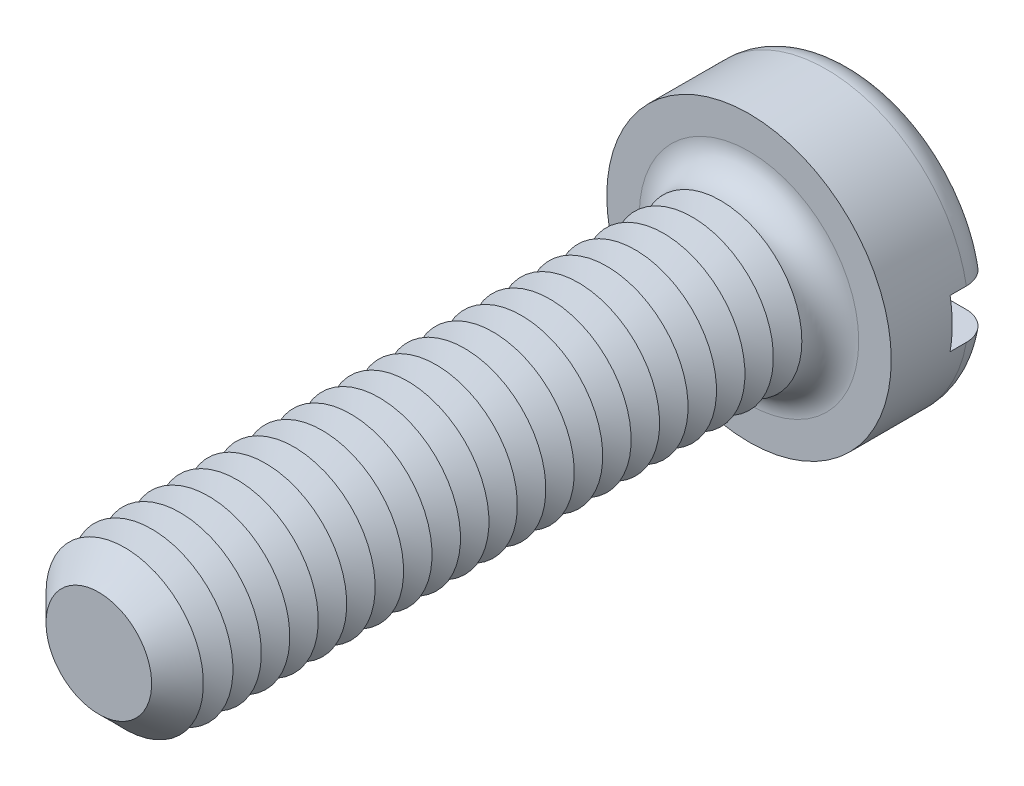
ISO-10303-21;
HEADER;
FILE_DESCRIPTION(('STEP AP214'),'2;1');
FILE_NAME('part.step','',(''),(''),'','','');
FILE_SCHEMA(('AUTOMOTIVE_DESIGN { 1 0 10303 214 1 1 1 1 }'));
ENDSEC;
DATA;
#1=APPLICATION_CONTEXT('core data for automotive mechanical design processes');
#2=APPLICATION_PROTOCOL_DEFINITION('international standard','automotive_design',2000,#1);
#3=PRODUCT_CONTEXT('',#1,'mechanical');
#4=PRODUCT('Part','Part','',(#3));
#5=PRODUCT_RELATED_PRODUCT_CATEGORY('part','',(#4));
#6=PRODUCT_DEFINITION_FORMATION('','',#4);
#7=PRODUCT_DEFINITION_CONTEXT('part definition',#1,'design');
#8=PRODUCT_DEFINITION('design','',#6,#7);
#9=PRODUCT_DEFINITION_SHAPE('','',#8);
#10=(LENGTH_UNIT() NAMED_UNIT(*) SI_UNIT(.MILLI.,.METRE.));
#11=(NAMED_UNIT(*) PLANE_ANGLE_UNIT() SI_UNIT($,.RADIAN.));
#12=(NAMED_UNIT(*) SI_UNIT($,.STERADIAN.) SOLID_ANGLE_UNIT());
#13=UNCERTAINTY_MEASURE_WITH_UNIT(LENGTH_MEASURE(1.E-05),#10,'distance_accuracy_value','');
#14=(GEOMETRIC_REPRESENTATION_CONTEXT(3) GLOBAL_UNCERTAINTY_ASSIGNED_CONTEXT((#13)) GLOBAL_UNIT_ASSIGNED_CONTEXT((#10,
#11,#12)) REPRESENTATION_CONTEXT('',''));
#15=CARTESIAN_POINT('',(0.,0.,0.));
#16=DIRECTION('',(0.,0.,1.));
#17=DIRECTION('',(1.,0.,0.));
#18=AXIS2_PLACEMENT_3D('',#15,#16,#17);
#19=CARTESIAN_POINT('',(0.,0.,-2.6));
#20=DIRECTION('',(0.,0.,1.));
#21=DIRECTION('',(1.,0.,0.));
#22=AXIS2_PLACEMENT_3D('',#19,#20,#21);
#23=PLANE('',#22);
#24=CARTESIAN_POINT('',(0.,0.,-2.6));
#25=DIRECTION('',(0.,0.,1.));
#26=DIRECTION('',(1.,0.,0.));
#27=AXIS2_PLACEMENT_3D('',#24,#25,#26);
#28=CIRCLE('',#27,2.8);
#29=CARTESIAN_POINT('',(-2.73495886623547,0.6,-2.6));
#30=VERTEX_POINT('',#29);
#31=CARTESIAN_POINT('',(2.73495886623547,0.6,-2.6));
#32=VERTEX_POINT('',#31);
#33=EDGE_CURVE('E116',#30,#32,#28,.F.);
#34=ORIENTED_EDGE('',*,*,#33,.T.);
#35=DIRECTION('',(1.,0.,0.));
#36=VECTOR('',#35,1.);
#37=CARTESIAN_POINT('',(-3.5,0.600000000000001,-2.6));
#38=LINE('',#37,#36);
#39=EDGE_CURVE('E111',#30,#32,#38,.T.);
#40=ORIENTED_EDGE('',*,*,#39,.F.);
#41=EDGE_LOOP('',(#34,#40));
#42=FACE_BOUND('',#41,.T.);
#43=ADVANCED_FACE('F39',(#42),#23,.F.);
#44=CARTESIAN_POINT('',(0.,0.,-1.9));
#45=DIRECTION('',(0.,0.,1.));
#46=DIRECTION('',(1.,0.,0.));
#47=AXIS2_PLACEMENT_3D('',#44,#45,#46);
#48=TOROIDAL_SURFACE('',#47,2.8,0.7);
#49=CARTESIAN_POINT('',(-3.24550494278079,0.600000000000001,-2.38938679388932));
#50=CARTESIAN_POINT('',(-3.21724139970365,0.600000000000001,-2.41780774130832));
#51=CARTESIAN_POINT('',(-3.18652103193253,0.600000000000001,-2.44383169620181));
#52=CARTESIAN_POINT('',(-3.12110229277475,0.600000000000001,-2.49034599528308));
#53=CARTESIAN_POINT('',(-3.08639834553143,0.6,-2.51082844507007));
#54=CARTESIAN_POINT('',(-3.01410013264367,0.6,-2.54568075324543));
#55=CARTESIAN_POINT('',(-2.97650963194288,0.6,-2.56005841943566));
#56=CARTESIAN_POINT('',(-2.89948250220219,0.6,-2.58239238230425));
#57=CARTESIAN_POINT('',(-2.86004633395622,0.6,-2.59035027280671));
#58=CARTESIAN_POINT('',(-2.77983715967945,0.6,-2.5997577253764));
#59=CARTESIAN_POINT('',(-2.73905311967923,0.6,-2.60111317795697));
#60=CARTESIAN_POINT('',(-2.65781876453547,0.6,-2.59706866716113));
#61=CARTESIAN_POINT('',(-2.61736849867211,0.6,-2.59166772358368));
#62=CARTESIAN_POINT('',(-2.53729983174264,0.6,-2.57414594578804));
#63=CARTESIAN_POINT('',(-2.49770360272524,0.6,-2.56192363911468));
#64=CARTESIAN_POINT('',(-2.421111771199,0.6,-2.5310238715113));
#65=CARTESIAN_POINT('',(-2.38411632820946,0.6,-2.51234601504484));
#66=CARTESIAN_POINT('',(-2.31371213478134,0.6,-2.46896762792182));
#67=CARTESIAN_POINT('',(-2.28031240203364,0.6,-2.44425244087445));
#68=CARTESIAN_POINT('',(-2.21823311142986,0.6,-2.38946667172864));
#69=CARTESIAN_POINT('',(-2.18955321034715,0.6,-2.35939647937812));
#70=CARTESIAN_POINT('',(-2.13836074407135,0.6,-2.29532787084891));
#71=CARTESIAN_POINT('',(-2.11574147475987,0.6,-2.26141482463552));
#72=CARTESIAN_POINT('',(-2.07677080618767,0.6,-2.19015935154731));
#73=CARTESIAN_POINT('',(-2.06041784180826,0.6,-2.15281778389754));
#74=CARTESIAN_POINT('',(-2.03508596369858,0.6,-2.07723332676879));
#75=CARTESIAN_POINT('',(-2.02585871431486,0.6,-2.03907365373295));
#76=CARTESIAN_POINT('',(-2.01416722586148,0.6,-1.96173417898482));
#77=CARTESIAN_POINT('',(-2.01170151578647,0.6,-1.92255460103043));
#78=CARTESIAN_POINT('',(-2.01359934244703,0.6,-1.84555709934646));
#79=CARTESIAN_POINT('',(-2.01775787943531,0.6,-1.80773393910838));
#80=CARTESIAN_POINT('',(-2.03236373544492,0.6,-1.73332511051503));
#81=CARTESIAN_POINT('',(-2.04281097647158,0.6,-1.69673942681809));
#82=CARTESIAN_POINT('',(-2.06962963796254,0.6,-1.62577336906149));
#83=CARTESIAN_POINT('',(-2.08600685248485,0.6,-1.59139519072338));
#84=CARTESIAN_POINT('',(-2.12413495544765,0.6,-1.52576356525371));
#85=CARTESIAN_POINT('',(-2.14588657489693,0.6,-1.49451054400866));
#86=CARTESIAN_POINT('',(-2.19483541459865,0.6,-1.43498643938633));
#87=CARTESIAN_POINT('',(-2.22217844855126,0.6,-1.40683532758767));
#88=CARTESIAN_POINT('',(-2.28105616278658,0.6,-1.35532544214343));
#89=CARTESIAN_POINT('',(-2.3125916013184,0.6,-1.33196753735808));
#90=CARTESIAN_POINT('',(-2.38018779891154,0.6,-1.28984356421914));
#91=CARTESIAN_POINT('',(-2.41637068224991,0.6,-1.27127330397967));
#92=CARTESIAN_POINT('',(-2.49129688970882,0.6,-1.24032971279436));
#93=CARTESIAN_POINT('',(-2.53004053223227,0.6,-1.22795715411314));
#94=CARTESIAN_POINT('',(-2.6098393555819,0.6,-1.2095515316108));
#95=CARTESIAN_POINT('',(-2.65092550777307,0.6,-1.20365237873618));
#96=CARTESIAN_POINT('',(-2.7335069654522,0.6,-1.1988380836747));
#97=CARTESIAN_POINT('',(-2.7750022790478,0.6,-1.19992308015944));
#98=CARTESIAN_POINT('',(-2.85718851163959,0.6,-1.20909046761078));
#99=CARTESIAN_POINT('',(-2.8978799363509,0.6,-1.21716830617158));
#100=CARTESIAN_POINT('',(-2.97729176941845,0.6,-1.24014327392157));
#101=CARTESIAN_POINT('',(-3.01601231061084,0.6,-1.25503994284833));
#102=CARTESIAN_POINT('',(-3.08976822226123,0.6,-1.29101066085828));
#103=CARTESIAN_POINT('',(-3.12484927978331,0.600000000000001,-1.31199098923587));
#104=CARTESIAN_POINT('',(-3.19090022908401,0.600000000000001,-1.35965144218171));
#105=CARTESIAN_POINT('',(-3.22187053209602,0.600000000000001,-1.38633099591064));
#106=CARTESIAN_POINT('',(-3.2781946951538,0.600000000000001,-1.44408564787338));
#107=CARTESIAN_POINT('',(-3.3036441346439,0.600000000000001,-1.47506754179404));
#108=CARTESIAN_POINT('',(-3.34887649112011,0.600000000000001,-1.54092398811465));
#109=CARTESIAN_POINT('',(-3.36865993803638,0.600000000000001,-1.57579817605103));
#110=CARTESIAN_POINT('',(-3.40166738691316,0.600000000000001,-1.64783067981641));
#111=CARTESIAN_POINT('',(-3.41499360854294,0.600000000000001,-1.68494217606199));
#112=CARTESIAN_POINT('',(-3.43515375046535,0.600000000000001,-1.76088675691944));
#113=CARTESIAN_POINT('',(-3.44198836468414,0.600000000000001,-1.79971965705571));
#114=CARTESIAN_POINT('',(-3.44891916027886,0.600000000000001,-1.87757893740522));
#115=CARTESIAN_POINT('',(-3.44908375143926,0.600000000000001,-1.91659924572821));
#116=CARTESIAN_POINT('',(-3.44284111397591,0.600000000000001,-1.99412088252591));
#117=CARTESIAN_POINT('',(-3.43643236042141,0.600000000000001,-2.03262208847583));
#118=CARTESIAN_POINT('',(-3.41725803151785,0.600000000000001,-2.10792315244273));
#119=CARTESIAN_POINT('',(-3.40450469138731,0.600000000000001,-2.14472613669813));
#120=CARTESIAN_POINT('',(-3.3730385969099,0.600000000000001,-2.21565060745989));
#121=CARTESIAN_POINT('',(-3.35433321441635,0.600000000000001,-2.24977534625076));
#122=CARTESIAN_POINT('',(-3.3201892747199,0.600000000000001,-2.30136364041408));
#123=CARTESIAN_POINT('',(-3.30647805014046,0.600000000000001,-2.31999402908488));
#124=CARTESIAN_POINT('',(-3.27728518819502,0.600000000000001,-2.35581090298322));
#125=CARTESIAN_POINT('',(-3.26180356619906,0.600000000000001,-2.37299740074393));
#126=CARTESIAN_POINT('',(-3.24550494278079,0.600000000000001,-2.38938679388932));
#127=B_SPLINE_CURVE_WITH_KNOTS('',3,(#49,#50,#51,#52,#53,#54,#55,#56,#57,#58,#59,#60,#61,#62,
#63,#64,#65,#66,#67,#68,#69,#70,#71,#72,#73,#74,#75,#76,#77,#78,#79,#80,#81,#82,#83,#84,#85,#86,
#87,#88,#89,#90,#91,#92,#93,#94,#95,#96,#97,#98,#99,#100,#101,#102,#103,#104,#105,#106,#107,
#108,#109,#110,#111,#112,#113,#114,#115,#116,#117,#118,#119,#120,#121,#122,#123,#124,#125,#126),
.UNSPECIFIED.,.T.,.F.,(4,2,2,2,2,2,2,2,2,2,2,2,2,2,2,2,2,2,2,2,2,2,2,2,2,2,2,2,2,2,2,2,2,2,2,2,
2,2,4),(0.,0.120160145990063,0.240490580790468,0.36066665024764,0.480812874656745,
0.602666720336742,0.724538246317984,0.848272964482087,0.972015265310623,1.09606100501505,
1.2200977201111,1.34178071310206,1.46343329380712,1.58062647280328,1.6977941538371,
1.81140573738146,1.92501591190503,2.03873739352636,2.15247435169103,2.26967910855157,
2.38690509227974,2.50835551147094,2.62982106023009,2.75375450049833,2.87769040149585,
3.00154567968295,3.12539259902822,3.24742469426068,3.36944457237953,3.48914477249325,
3.60883377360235,3.72656056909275,3.84427477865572,3.96078136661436,4.07731498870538,
4.19362474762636,4.3097910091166,4.37908387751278,4.44837614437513),.UNSPECIFIED.);
#128=CARTESIAN_POINT('',(-3.44818792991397,0.600000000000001,-1.8999999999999));
#129=VERTEX_POINT('',#128);
#130=EDGE_CURVE('E353',#129,#30,#127,.T.);
#131=ORIENTED_EDGE('',*,*,#130,.F.);
#132=CARTESIAN_POINT('',(0.,0.,-1.9));
#133=DIRECTION('',(0.,0.,1.));
#134=DIRECTION('',(1.,0.,0.));
#135=AXIS2_PLACEMENT_3D('',#132,#133,#134);
#136=CIRCLE('',#135,3.5);
#137=CARTESIAN_POINT('',(3.44818792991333,0.6,-1.9));
#138=VERTEX_POINT('',#137);
#139=EDGE_CURVE('E125',#138,#129,#136,.T.);
#140=ORIENTED_EDGE('',*,*,#139,.F.);
#141=CARTESIAN_POINT('',(2.1414268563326,0.6,-2.29762171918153));
#142=CARTESIAN_POINT('',(2.16505443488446,0.6,-2.33058245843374));
#143=CARTESIAN_POINT('',(2.19155609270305,0.6,-2.36152717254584));
#144=CARTESIAN_POINT('',(2.24942944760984,0.6,-2.41852964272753));
#145=CARTESIAN_POINT('',(2.28080921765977,0.6,-2.44457913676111));
#146=CARTESIAN_POINT('',(2.34741203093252,0.6,-2.49105381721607));
#147=CARTESIAN_POINT('',(2.38262862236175,0.6,-2.51148824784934));
#148=CARTESIAN_POINT('',(2.45593176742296,0.6,-2.54626881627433));
#149=CARTESIAN_POINT('',(2.49401741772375,0.6,-2.56061686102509));
#150=CARTESIAN_POINT('',(2.57272605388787,0.6,-2.58306429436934));
#151=CARTESIAN_POINT('',(2.6133821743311,0.6,-2.59104769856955));
#152=CARTESIAN_POINT('',(2.6954618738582,0.6,-2.60009608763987));
#153=CARTESIAN_POINT('',(2.73688552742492,0.6,-2.60116039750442));
#154=CARTESIAN_POINT('',(2.81941950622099,0.6,-2.5962925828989));
#155=CARTESIAN_POINT('',(2.86052888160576,0.6,-2.59034422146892));
#156=CARTESIAN_POINT('',(2.94113709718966,0.6,-2.57153687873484));
#157=CARTESIAN_POINT('',(2.98063603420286,0.6,-2.55867831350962));
#158=CARTESIAN_POINT('',(3.05633735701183,0.6,-2.52657771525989));
#159=CARTESIAN_POINT('',(3.09257627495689,0.6,-2.50742188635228));
#160=CARTESIAN_POINT('',(3.16123898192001,0.6,-2.46318606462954));
#161=CARTESIAN_POINT('',(3.19366316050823,0.6,-2.4381066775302));
#162=CARTESIAN_POINT('',(3.25312278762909,0.6,-2.38324481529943));
#163=CARTESIAN_POINT('',(3.28024842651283,0.6,-2.35356008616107));
#164=CARTESIAN_POINT('',(3.32902587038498,0.6,-2.28998971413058));
#165=CARTESIAN_POINT('',(3.35067820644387,0.6,-2.25610447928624));
#166=CARTESIAN_POINT('',(3.38751207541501,0.6,-2.18572286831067));
#167=CARTESIAN_POINT('',(3.40279804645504,0.6,-2.14928112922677));
#168=CARTESIAN_POINT('',(3.42695590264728,0.6,-2.07433042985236));
#169=CARTESIAN_POINT('',(3.43582824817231,0.6,-2.03582161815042));
#170=CARTESIAN_POINT('',(3.44682113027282,0.6,-1.95829536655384));
#171=CARTESIAN_POINT('',(3.44901648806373,0.6,-1.91928851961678));
#172=CARTESIAN_POINT('',(3.44680085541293,0.6,-1.84146366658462));
#173=CARTESIAN_POINT('',(3.44239008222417,0.6,-1.80264565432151));
#174=CARTESIAN_POINT('',(3.42712544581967,0.6,-1.72644634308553));
#175=CARTESIAN_POINT('',(3.41629508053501,0.6,-1.6890603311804));
#176=CARTESIAN_POINT('',(3.38853757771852,0.6,-1.61662604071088));
#177=CARTESIAN_POINT('',(3.37161039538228,0.6,-1.58157777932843));
#178=CARTESIAN_POINT('',(3.33207798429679,0.6,-1.51464178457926));
#179=CARTESIAN_POINT('',(3.30944854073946,0.6,-1.48276835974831));
#180=CARTESIAN_POINT('',(3.2592165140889,0.6,-1.42321861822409));
#181=CARTESIAN_POINT('',(3.23161370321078,0.6,-1.3955424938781));
#182=CARTESIAN_POINT('',(3.17188519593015,0.6,-1.34481834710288));
#183=CARTESIAN_POINT('',(3.13971065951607,0.6,-1.32182785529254));
#184=CARTESIAN_POINT('',(3.07201123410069,0.6,-1.28147003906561));
#185=CARTESIAN_POINT('',(3.03648608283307,0.6,-1.26410315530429));
#186=CARTESIAN_POINT('',(2.962449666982,0.6,-1.2351645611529));
#187=CARTESIAN_POINT('',(2.92389781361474,0.6,-1.22369671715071));
#188=CARTESIAN_POINT('',(2.84543273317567,0.6,-1.20726565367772));
#189=CARTESIAN_POINT('',(2.80551936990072,0.6,-1.20230308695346));
#190=CARTESIAN_POINT('',(2.72467191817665,0.6,-1.1989357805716));
#191=CARTESIAN_POINT('',(2.68373266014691,0.6,-1.20065484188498));
#192=CARTESIAN_POINT('',(2.60270222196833,0.6,-1.21084560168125));
#193=CARTESIAN_POINT('',(2.56261112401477,0.6,-1.21931795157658));
#194=CARTESIAN_POINT('',(2.48385954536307,0.6,-1.24292934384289));
#195=CARTESIAN_POINT('',(2.44522508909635,0.6,-1.25815531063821));
#196=CARTESIAN_POINT('',(2.37106165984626,0.6,-1.29488663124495));
#197=CARTESIAN_POINT('',(2.33553282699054,0.6,-1.31639226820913));
#198=CARTESIAN_POINT('',(2.2686996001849,0.6,-1.36507949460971));
#199=CARTESIAN_POINT('',(2.23738745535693,0.6,-1.39225042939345));
#200=CARTESIAN_POINT('',(2.17990424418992,0.6,-1.45157941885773));
#201=CARTESIAN_POINT('',(2.15373259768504,0.6,-1.48373691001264));
#202=CARTESIAN_POINT('',(2.10799355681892,0.6,-1.551327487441));
#203=CARTESIAN_POINT('',(2.08828258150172,0.6,-1.58666329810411));
#204=CARTESIAN_POINT('',(2.05534440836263,0.6,-1.66023600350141));
#205=CARTESIAN_POINT('',(2.042115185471,0.6,-1.6984719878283));
#206=CARTESIAN_POINT('',(2.02303126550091,0.6,-1.77519783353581));
#207=CARTESIAN_POINT('',(2.01691541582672,0.6,-1.8136228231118));
#208=CARTESIAN_POINT('',(2.01140375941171,0.6,-1.89096056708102));
#209=CARTESIAN_POINT('',(2.01200856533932,0.6,-1.92987336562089));
#210=CARTESIAN_POINT('',(2.01981617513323,0.6,-2.006065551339));
#211=CARTESIAN_POINT('',(2.02685835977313,0.6,-2.04336165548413));
#212=CARTESIAN_POINT('',(2.0470502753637,0.6,-2.1162250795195));
#213=CARTESIAN_POINT('',(2.06019252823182,0.6,-2.15179445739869));
#214=CARTESIAN_POINT('',(2.08525738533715,0.6,-2.20558874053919));
#215=CARTESIAN_POINT('',(2.09529161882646,0.6,-2.22471751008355));
#216=CARTESIAN_POINT('',(2.11708813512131,0.6,-2.26196179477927));
#217=CARTESIAN_POINT('',(2.12885034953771,0.6,-2.28007734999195));
#218=CARTESIAN_POINT('',(2.1414268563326,0.6,-2.29762171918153));
#219=B_SPLINE_CURVE_WITH_KNOTS('',3,(#141,#142,#143,#144,#145,#146,#147,#148,#149,#150,#151,
#152,#153,#154,#155,#156,#157,#158,#159,#160,#161,#162,#163,#164,#165,#166,#167,#168,#169,#170,
#171,#172,#173,#174,#175,#176,#177,#178,#179,#180,#181,#182,#183,#184,#185,#186,#187,#188,#189,
#190,#191,#192,#193,#194,#195,#196,#197,#198,#199,#200,#201,#202,#203,#204,#205,#206,#207,#208,
#209,#210,#211,#212,#213,#214,#215,#216,#217,#218),.UNSPECIFIED.,.T.,.F.,(4,2,2,2,2,2,2,2,2,2,2,
2,2,2,2,2,2,2,2,2,2,2,2,2,2,2,2,2,2,2,2,2,2,2,2,2,2,2,4),(0.,0.121582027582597,
0.243367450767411,0.364951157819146,0.486496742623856,0.610209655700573,0.733934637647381,
0.857946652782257,0.981951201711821,1.1043243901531,1.22668507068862,1.34673532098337,
1.46677391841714,1.58475736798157,1.70273234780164,1.81938035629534,1.93602452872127,
2.05224435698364,2.168465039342,2.28518782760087,2.40191596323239,2.52000081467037,
2.63809491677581,2.75820270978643,2.87832255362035,3.00067856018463,3.1230463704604,
3.24703703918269,3.37103329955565,3.49479843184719,3.6185495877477,3.73932715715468,
3.86006696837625,3.9762182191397,4.09238005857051,4.2057203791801,4.31892212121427,
4.38364046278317,4.44835624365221),.UNSPECIFIED.);
#220=EDGE_CURVE('E355',#32,#138,#219,.T.);
#221=ORIENTED_EDGE('',*,*,#220,.F.);
#222=ORIENTED_EDGE('',*,*,#33,.F.);
#223=EDGE_LOOP('',(#131,#140,#221,#222));
#224=FACE_BOUND('',#223,.T.);
#225=ADVANCED_FACE('F337',(#224),#48,.T.);
#226=CARTESIAN_POINT('',(0.,0.,-2.6));
#227=DIRECTION('',(0.,0.,1.));
#228=DIRECTION('',(1.,0.,0.));
#229=AXIS2_PLACEMENT_3D('',#226,#227,#228);
#230=CYLINDRICAL_SURFACE('',#229,3.5);
#231=DIRECTION('',(0.,0.,1.));
#232=VECTOR('',#231,1.);
#233=CARTESIAN_POINT('',(3.44818792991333,0.6,-2.6));
#234=LINE('',#233,#232);
#235=CARTESIAN_POINT('',(3.44818792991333,0.6,-1.5));
#236=VERTEX_POINT('',#235);
#237=EDGE_CURVE('E369',#138,#236,#234,.T.);
#238=ORIENTED_EDGE('',*,*,#237,.F.);
#239=ORIENTED_EDGE('',*,*,#139,.T.);
#240=DIRECTION('',(0.,0.,1.));
#241=VECTOR('',#240,1.);
#242=CARTESIAN_POINT('',(-3.44818792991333,0.600000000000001,-2.6));
#243=LINE('',#242,#241);
#244=CARTESIAN_POINT('',(-3.44818792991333,0.600000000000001,-1.5));
#245=VERTEX_POINT('',#244);
#246=EDGE_CURVE('E63',#245,#129,#243,.F.);
#247=ORIENTED_EDGE('',*,*,#246,.F.);
#248=CARTESIAN_POINT('',(0.,0.,-1.5));
#249=DIRECTION('',(0.,0.,-1.));
#250=DIRECTION('',(-1.,0.,0.));
#251=AXIS2_PLACEMENT_3D('',#248,#249,#250);
#252=CIRCLE('',#251,3.5);
#253=CARTESIAN_POINT('',(-3.44818792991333,-0.599999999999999,-1.5));
#254=VERTEX_POINT('',#253);
#255=EDGE_CURVE('E43',#245,#254,#252,.F.);
#256=ORIENTED_EDGE('',*,*,#255,.T.);
#257=DIRECTION('',(0.,0.,1.));
#258=VECTOR('',#257,1.);
#259=CARTESIAN_POINT('',(-3.44818792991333,-0.599999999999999,-2.6));
#260=LINE('',#259,#258);
#261=CARTESIAN_POINT('',(-3.44818792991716,-0.599999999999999,-1.90000000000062));
#262=VERTEX_POINT('',#261);
#263=EDGE_CURVE('E367',#262,#254,#260,.T.);
#264=ORIENTED_EDGE('',*,*,#263,.F.);
#265=CARTESIAN_POINT('',(3.44818792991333,-0.6,-1.9));
#266=VERTEX_POINT('',#265);
#267=EDGE_CURVE('E127',#262,#266,#136,.T.);
#268=ORIENTED_EDGE('',*,*,#267,.T.);
#269=DIRECTION('',(0.,0.,1.));
#270=VECTOR('',#269,1.);
#271=CARTESIAN_POINT('',(3.44818792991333,-0.6,-2.6));
#272=LINE('',#271,#270);
#273=CARTESIAN_POINT('',(3.44818792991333,-0.6,-1.5));
#274=VERTEX_POINT('',#273);
#275=EDGE_CURVE('E55',#274,#266,#272,.F.);
#276=ORIENTED_EDGE('',*,*,#275,.F.);
#277=EDGE_CURVE('E11',#274,#236,#252,.F.);
#278=ORIENTED_EDGE('',*,*,#277,.T.);
#279=EDGE_LOOP('',(#238,#239,#247,#256,#264,#268,#276,#278));
#280=FACE_BOUND('',#279,.T.);
#281=CARTESIAN_POINT('',(0.,0.,0.));
#282=DIRECTION('',(0.,0.,1.));
#283=DIRECTION('',(1.,0.,0.));
#284=AXIS2_PLACEMENT_3D('',#281,#282,#283);
#285=CIRCLE('',#284,3.5);
#286=CARTESIAN_POINT('',(3.5,0.,0.));
#287=VERTEX_POINT('',#286);
#288=EDGE_CURVE('E372',#287,#287,#285,.T.);
#289=ORIENTED_EDGE('',*,*,#288,.F.);
#290=EDGE_LOOP('',(#289));
#291=FACE_BOUND('',#290,.T.);
#292=ADVANCED_FACE('F333',(#280,#291),#230,.T.);
#293=CARTESIAN_POINT('',(2.73495886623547,-0.6,-2.6));
#294=VERTEX_POINT('',#293);
#295=CARTESIAN_POINT('',(-2.73495886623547,-0.6,-2.6));
#296=VERTEX_POINT('',#295);
#297=EDGE_CURVE('E109',#294,#296,#28,.F.);
#298=ORIENTED_EDGE('',*,*,#297,.T.);
#299=DIRECTION('',(-1.,0.,0.));
#300=VECTOR('',#299,1.);
#301=CARTESIAN_POINT('',(-3.5,-0.599999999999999,-2.6));
#302=LINE('',#301,#300);
#303=EDGE_CURVE('E96',#294,#296,#302,.T.);
#304=ORIENTED_EDGE('',*,*,#303,.F.);
#305=EDGE_LOOP('',(#298,#304));
#306=FACE_BOUND('',#305,.T.);
#307=ADVANCED_FACE('F108',(#306),#23,.F.);
#308=CARTESIAN_POINT('',(0.,0.,0.));
#309=DIRECTION('',(0.,0.,1.));
#310=DIRECTION('',(1.,0.,0.));
#311=AXIS2_PLACEMENT_3D('',#308,#309,#310);
#312=PLANE('',#311);
#313=CARTESIAN_POINT('',(0.,0.,0.));
#314=DIRECTION('',(0.,0.,1.));
#315=DIRECTION('',(1.,0.,0.));
#316=AXIS2_PLACEMENT_3D('',#313,#314,#315);
#317=CIRCLE('',#316,2.7);
#318=CARTESIAN_POINT('',(2.7,0.,0.));
#319=VERTEX_POINT('',#318);
#320=EDGE_CURVE('E115',#319,#319,#317,.F.);
#321=ORIENTED_EDGE('',*,*,#320,.T.);
#322=EDGE_LOOP('',(#321));
#323=FACE_BOUND('',#322,.T.);
#324=ORIENTED_EDGE('',*,*,#288,.T.);
#325=EDGE_LOOP('',(#324));
#326=FACE_BOUND('',#325,.T.);
#327=ADVANCED_FACE('F332',(#323,#326),#312,.T.);
#328=CARTESIAN_POINT('',(-3.24550494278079,-0.599999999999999,-2.38938679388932));
#329=CARTESIAN_POINT('',(-3.27309693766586,-0.599999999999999,-2.36163611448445));
#330=CARTESIAN_POINT('',(-3.29838741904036,-0.599999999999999,-2.3315608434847));
#331=CARTESIAN_POINT('',(-3.34359429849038,-0.599999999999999,-2.26757659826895));
#332=CARTESIAN_POINT('',(-3.36350518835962,-0.599999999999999,-2.23366374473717));
#333=CARTESIAN_POINT('',(-3.39733065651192,-0.599999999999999,-2.16296274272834));
#334=CARTESIAN_POINT('',(-3.4112451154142,-0.599999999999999,-2.12617453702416));
#335=CARTESIAN_POINT('',(-3.43264462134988,-0.599999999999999,-2.05078178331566));
#336=CARTESIAN_POINT('',(-3.44013114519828,-0.599999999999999,-2.01217765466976));
#337=CARTESIAN_POINT('',(-3.44841975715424,-0.599999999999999,-1.9345391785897));
#338=CARTESIAN_POINT('',(-3.44926944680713,-0.599999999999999,-1.89550990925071));
#339=CARTESIAN_POINT('',(-3.44438358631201,-0.599999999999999,-1.81786552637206));
#340=CARTESIAN_POINT('',(-3.43864801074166,-0.599999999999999,-1.77925041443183));
#341=CARTESIAN_POINT('',(-3.42079221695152,-0.599999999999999,-1.70364264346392));
#342=CARTESIAN_POINT('',(-3.40869011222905,-0.599999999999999,-1.66664570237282));
#343=CARTESIAN_POINT('',(-3.37847692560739,-0.599999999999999,-1.59519424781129));
#344=CARTESIAN_POINT('',(-3.3603657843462,-0.599999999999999,-1.56073975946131));
#345=CARTESIAN_POINT('',(-3.31856549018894,-0.599999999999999,-1.4951524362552));
#346=CARTESIAN_POINT('',(-3.29484830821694,-0.599999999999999,-1.46403747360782));
#347=CARTESIAN_POINT('',(-3.24258489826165,-0.599999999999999,-1.40617131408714));
#348=CARTESIAN_POINT('',(-3.21403843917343,-0.599999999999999,-1.37942032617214));
#349=CARTESIAN_POINT('',(-3.15256084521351,-0.599999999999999,-1.33067963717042));
#350=CARTESIAN_POINT('',(-3.11958015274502,-0.599999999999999,-1.30875246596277));
#351=CARTESIAN_POINT('',(-3.0504559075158,-0.599999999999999,-1.27063718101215));
#352=CARTESIAN_POINT('',(-3.01431209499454,-0.6,-1.25444953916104));
#353=CARTESIAN_POINT('',(-2.93921710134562,-0.6,-1.22796796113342));
#354=CARTESIAN_POINT('',(-2.90022796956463,-0.6,-1.217781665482));
#355=CARTESIAN_POINT('',(-2.82110512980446,-0.6,-1.20396915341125));
#356=CARTESIAN_POINT('',(-2.7809713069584,-0.6,-1.2003435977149));
#357=CARTESIAN_POINT('',(-2.69990924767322,-0.6,-1.19969717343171));
#358=CARTESIAN_POINT('',(-2.65898001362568,-0.6,-1.20279937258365));
#359=CARTESIAN_POINT('',(-2.57819986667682,-0.6,-1.21574287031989));
#360=CARTESIAN_POINT('',(-2.53834905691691,-0.6,-1.22558481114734));
#361=CARTESIAN_POINT('',(-2.46035232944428,-0.6,-1.25189361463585));
#362=CARTESIAN_POINT('',(-2.42223314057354,-0.6,-1.2684398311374));
#363=CARTESIAN_POINT('',(-2.34932316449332,-0.6,-1.30771928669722));
#364=CARTESIAN_POINT('',(-2.31453248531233,-0.6,-1.33045272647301));
#365=CARTESIAN_POINT('',(-2.24945577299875,-0.6,-1.38141543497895));
#366=CARTESIAN_POINT('',(-2.21915255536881,-0.6,-1.40962272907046));
#367=CARTESIAN_POINT('',(-2.16386461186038,-0.6,-1.47084552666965));
#368=CARTESIAN_POINT('',(-2.13887916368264,-0.6,-1.50386037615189));
#369=CARTESIAN_POINT('',(-2.09568071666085,-0.6,-1.57285917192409));
#370=CARTESIAN_POINT('',(-2.07730739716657,-0.6,-1.60874263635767));
#371=CARTESIAN_POINT('',(-2.04712019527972,-0.6,-1.68316975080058));
#372=CARTESIAN_POINT('',(-2.03530452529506,-0.6,-1.72171267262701));
#373=CARTESIAN_POINT('',(-2.01901751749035,-0.6,-1.79878952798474));
#374=CARTESIAN_POINT('',(-2.01428434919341,-0.6,-1.8372682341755));
#375=CARTESIAN_POINT('',(-2.01150652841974,-0.6,-1.91446369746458));
#376=CARTESIAN_POINT('',(-2.01346084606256,-0.6,-1.95318041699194));
#377=CARTESIAN_POINT('',(-2.02386268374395,-0.6,-2.0288619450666));
#378=CARTESIAN_POINT('',(-2.03216724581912,-0.6,-2.06584654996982));
#379=CARTESIAN_POINT('',(-2.05479337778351,-0.6,-2.13792373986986));
#380=CARTESIAN_POINT('',(-2.06911522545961,-0.6,-2.1730162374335));
#381=CARTESIAN_POINT('',(-2.10349906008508,-0.6,-2.24081034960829));
#382=CARTESIAN_POINT('',(-2.12363007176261,-0.6,-2.27347689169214));
#383=CARTESIAN_POINT('',(-2.16891308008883,-0.6,-2.33511902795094));
#384=CARTESIAN_POINT('',(-2.19406590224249,-0.6,-2.36409401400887));
#385=CARTESIAN_POINT('',(-2.24962389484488,-0.6,-2.41861972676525));
#386=CARTESIAN_POINT('',(-2.28018314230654,-0.6,-2.44401345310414));
#387=CARTESIAN_POINT('',(-2.34501720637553,-0.6,-2.48950558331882));
#388=CARTESIAN_POINT('',(-2.37929266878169,-0.6,-2.50960306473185));
#389=CARTESIAN_POINT('',(-2.45179417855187,-0.6,-2.54458276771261));
#390=CARTESIAN_POINT('',(-2.49011248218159,-0.6,-2.55927401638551));
#391=CARTESIAN_POINT('',(-2.56865227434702,-0.6,-2.58211133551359));
#392=CARTESIAN_POINT('',(-2.60887386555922,-0.6,-2.59025705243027));
#393=CARTESIAN_POINT('',(-2.69064746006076,-0.6,-2.59982905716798));
#394=CARTESIAN_POINT('',(-2.73220999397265,-0.6,-2.60116580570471));
#395=CARTESIAN_POINT('',(-2.81497658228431,-0.6,-2.59679700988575));
#396=CARTESIAN_POINT('',(-2.85618055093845,-0.6,-2.59108982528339));
#397=CARTESIAN_POINT('',(-2.93677683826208,-0.6,-2.57279487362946));
#398=CARTESIAN_POINT('',(-2.97617834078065,-0.6,-2.56024753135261));
#399=CARTESIAN_POINT('',(-3.05222242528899,-0.6,-2.52860709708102));
#400=CARTESIAN_POINT('',(-3.08886850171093,-0.599999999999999,-2.50952247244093));
#401=CARTESIAN_POINT('',(-3.14562501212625,-0.599999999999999,-2.47340693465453));
#402=CARTESIAN_POINT('',(-3.16689358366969,-0.599999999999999,-2.45816337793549));
#403=CARTESIAN_POINT('',(-3.20761866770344,-0.599999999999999,-2.42542115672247));
#404=CARTESIAN_POINT('',(-3.22707520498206,-0.599999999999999,-2.40792252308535));
#405=CARTESIAN_POINT('',(-3.24550494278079,-0.599999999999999,-2.38938679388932));
#406=B_SPLINE_CURVE_WITH_KNOTS('',3,(#328,#329,#330,#331,#332,#333,#334,#335,#336,#337,#338,
#339,#340,#341,#342,#343,#344,#345,#346,#347,#348,#349,#350,#351,#352,#353,#354,#355,#356,#357,
#358,#359,#360,#361,#362,#363,#364,#365,#366,#367,#368,#369,#370,#371,#372,#373,#374,#375,#376,
#377,#378,#379,#380,#381,#382,#383,#384,#385,#386,#387,#388,#389,#390,#391,#392,#393,#394,#395,
#396,#397,#398,#399,#400,#401,#402,#403,#404,#405),.UNSPECIFIED.,.T.,.F.,(4,2,2,2,2,2,2,2,2,2,2,
2,2,2,2,2,2,2,2,2,2,2,2,2,2,2,2,2,2,2,2,2,2,2,2,2,2,2,4),(0.,0.117306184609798,
0.234732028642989,0.352160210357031,0.469561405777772,0.586119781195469,0.702678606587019,
0.818907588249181,0.935137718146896,1.05196174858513,1.1687913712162,1.2870562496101,
1.40533084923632,1.52566688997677,1.64601504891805,1.76858322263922,1.89116307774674,
2.01523830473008,2.13931755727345,2.26290863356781,2.38648291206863,2.50681878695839,
2.62712184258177,2.74285697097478,2.85857427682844,2.97176054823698,3.08495204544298,
3.19954814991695,3.31416310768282,3.43282436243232,3.55150627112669,3.67404987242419,
3.79660009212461,3.92075778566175,4.04494439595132,4.16840490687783,4.29170610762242,
4.3700604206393,4.44841366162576),.UNSPECIFIED.);
#407=EDGE_CURVE('E103',#296,#262,#406,.T.);
#408=ORIENTED_EDGE('',*,*,#407,.F.);
#409=ORIENTED_EDGE('',*,*,#297,.F.);
#410=CARTESIAN_POINT('',(2.1414268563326,-0.6,-2.29762171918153));
#411=CARTESIAN_POINT('',(2.11900044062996,-0.6,-2.26633119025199));
#412=CARTESIAN_POINT('',(2.09913154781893,-0.6,-2.23318080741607));
#413=CARTESIAN_POINT('',(2.06517900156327,-0.6,-2.16401111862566));
#414=CARTESIAN_POINT('',(2.05109968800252,-0.6,-2.12798968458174));
#415=CARTESIAN_POINT('',(2.02923593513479,-0.6,-2.05404277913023));
#416=CARTESIAN_POINT('',(2.02145692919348,-0.6,-2.01611569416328));
#417=CARTESIAN_POINT('',(2.01251710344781,-0.6,-1.93949649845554));
#418=CARTESIAN_POINT('',(2.01135461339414,-0.6,-1.90080458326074));
#419=CARTESIAN_POINT('',(2.01564803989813,-0.6,-1.82450508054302));
#420=CARTESIAN_POINT('',(2.02098305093,-0.6,-1.78689061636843));
#421=CARTESIAN_POINT('',(2.03786826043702,-0.6,-1.71308589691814));
#422=CARTESIAN_POINT('',(2.04941870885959,-0.6,-1.67689569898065));
#423=CARTESIAN_POINT('',(2.07838664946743,-0.6,-1.60676639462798));
#424=CARTESIAN_POINT('',(2.09582944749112,-0.6,-1.57283776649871));
#425=CARTESIAN_POINT('',(2.1359925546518,-0.6,-1.50826612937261));
#426=CARTESIAN_POINT('',(2.15871360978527,-0.6,-1.47762358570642));
#427=CARTESIAN_POINT('',(2.20955413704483,-0.6,-1.41943384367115));
#428=CARTESIAN_POINT('',(2.23782364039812,-0.6,-1.39201777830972));
#429=CARTESIAN_POINT('',(2.29842612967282,-0.6,-1.34212199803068));
#430=CARTESIAN_POINT('',(2.33075984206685,-0.6,-1.31964316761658));
#431=CARTESIAN_POINT('',(2.399806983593,-0.6,-1.27945238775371));
#432=CARTESIAN_POINT('',(2.43663466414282,-0.6,-1.26193653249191));
#433=CARTESIAN_POINT('',(2.51267241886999,-0.6,-1.23320660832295));
#434=CARTESIAN_POINT('',(2.55188277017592,-0.6,-1.22199327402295));
#435=CARTESIAN_POINT('',(2.63235000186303,-0.6,-1.20602688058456));
#436=CARTESIAN_POINT('',(2.673631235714,-0.6,-1.20139617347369));
#437=CARTESIAN_POINT('',(2.7563863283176,-0.6,-1.19914622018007));
#438=CARTESIAN_POINT('',(2.79786018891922,-0.6,-1.20152704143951));
#439=CARTESIAN_POINT('',(2.87971192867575,-0.6,-1.21326884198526));
#440=CARTESIAN_POINT('',(2.92009214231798,-0.6,-1.22261349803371));
#441=CARTESIAN_POINT('',(2.99866777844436,-0.6,-1.24805614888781));
#442=CARTESIAN_POINT('',(3.03686335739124,-0.6,-1.26415365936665));
#443=CARTESIAN_POINT('',(3.10934738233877,-0.6,-1.3023912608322));
#444=CARTESIAN_POINT('',(3.14368704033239,-0.6,-1.32443423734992));
#445=CARTESIAN_POINT('',(3.20808395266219,-0.6,-1.37407725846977));
#446=CARTESIAN_POINT('',(3.23814164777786,-0.6,-1.40167673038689));
#447=CARTESIAN_POINT('',(3.29251534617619,-0.6,-1.46108303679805));
#448=CARTESIAN_POINT('',(3.3169296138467,-0.6,-1.49279994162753));
#449=CARTESIAN_POINT('',(3.35998418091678,-0.6,-1.55993706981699));
#450=CARTESIAN_POINT('',(3.37862502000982,-0.6,-1.59535694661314));
#451=CARTESIAN_POINT('',(3.40930212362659,-0.6,-1.668283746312));
#452=CARTESIAN_POINT('',(3.42143897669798,-0.6,-1.70574837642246));
#453=CARTESIAN_POINT('',(3.43918305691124,-0.6,-1.78219297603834));
#454=CARTESIAN_POINT('',(3.44479069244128,-0.6,-1.82117285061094));
#455=CARTESIAN_POINT('',(3.44928173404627,-0.6,-1.89914596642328));
#456=CARTESIAN_POINT('',(3.44822835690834,-0.6,-1.93813558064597));
#457=CARTESIAN_POINT('',(3.43957811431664,-0.6,-2.0153811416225));
#458=CARTESIAN_POINT('',(3.43198139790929,-0.6,-2.05363710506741));
#459=CARTESIAN_POINT('',(3.41049386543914,-0.6,-2.12826741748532));
#460=CARTESIAN_POINT('',(3.39661362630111,-0.6,-2.16464481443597));
#461=CARTESIAN_POINT('',(3.36297924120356,-0.6,-2.23457274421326));
#462=CARTESIAN_POINT('',(3.34322499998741,-0.6,-2.26812323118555));
#463=CARTESIAN_POINT('',(3.29828706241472,-0.6,-2.33167864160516));
#464=CARTESIAN_POINT('',(3.27307040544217,-0.6,-2.36166024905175));
#465=CARTESIAN_POINT('',(3.21802069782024,-0.6,-2.41703165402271));
#466=CARTESIAN_POINT('',(3.18818738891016,-0.6,-2.44242119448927));
#467=CARTESIAN_POINT('',(3.12433871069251,-0.6,-2.48825551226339));
#468=CARTESIAN_POINT('',(3.09027338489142,-0.6,-2.50863067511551));
#469=CARTESIAN_POINT('',(3.01925175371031,-0.6,-2.54348754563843));
#470=CARTESIAN_POINT('',(2.982295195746,-0.6,-2.55796873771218));
#471=CARTESIAN_POINT('',(2.90583499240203,-0.6,-2.58090526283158));
#472=CARTESIAN_POINT('',(2.86629758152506,-0.6,-2.58924801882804));
#473=CARTESIAN_POINT('',(2.78639041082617,-0.6,-2.59930573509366));
#474=CARTESIAN_POINT('',(2.7460205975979,-0.6,-2.60102026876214));
#475=CARTESIAN_POINT('',(2.66482039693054,-0.6,-2.59779078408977));
#476=CARTESIAN_POINT('',(2.62399477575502,-0.6,-2.59272651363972));
#477=CARTESIAN_POINT('',(2.54373809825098,-0.6,-2.57588976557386));
#478=CARTESIAN_POINT('',(2.50430750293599,-0.6,-2.56411509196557));
#479=CARTESIAN_POINT('',(2.42753167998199,-0.6,-2.53401488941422));
#480=CARTESIAN_POINT('',(2.39021407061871,-0.6,-2.51561892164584));
#481=CARTESIAN_POINT('',(2.31925431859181,-0.6,-2.4727929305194));
#482=CARTESIAN_POINT('',(2.28560806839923,-0.6,-2.44836975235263));
#483=CARTESIAN_POINT('',(2.23316677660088,-0.6,-2.40295212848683));
#484=CARTESIAN_POINT('',(2.21309339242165,-0.6,-2.38341311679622));
#485=CARTESIAN_POINT('',(2.17537212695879,-0.6,-2.34211733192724));
#486=CARTESIAN_POINT('',(2.1577241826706,-0.6,-2.32036061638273));
#487=CARTESIAN_POINT('',(2.1414268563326,-0.6,-2.29762171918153));
#488=B_SPLINE_CURVE_WITH_KNOTS('',3,(#410,#411,#412,#413,#414,#415,#416,#417,#418,#419,#420,
#421,#422,#423,#424,#425,#426,#427,#428,#429,#430,#431,#432,#433,#434,#435,#436,#437,#438,#439,
#440,#441,#442,#443,#444,#445,#446,#447,#448,#449,#450,#451,#452,#453,#454,#455,#456,#457,#458,
#459,#460,#461,#462,#463,#464,#465,#466,#467,#468,#469,#470,#471,#472,#473,#474,#475,#476,#477,
#478,#479,#480,#481,#482,#483,#484,#485,#486,#487),.UNSPECIFIED.,.T.,.F.,(4,2,2,2,2,2,2,2,2,2,2,
2,2,2,2,2,2,2,2,2,2,2,2,2,2,2,2,2,2,2,2,2,2,2,2,2,2,2,4),(0.,0.115394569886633,
0.230875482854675,0.346455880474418,0.462007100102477,0.575440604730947,0.688878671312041,
0.802810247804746,0.91675793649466,1.03436780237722,1.15199872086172,1.27377854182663,
1.39557255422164,1.51960202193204,1.64363268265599,1.76737352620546,1.89110549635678,
2.01292743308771,2.13473682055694,2.25423121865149,2.37371444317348,2.49129215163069,
2.60886250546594,2.72531873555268,2.8417723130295,2.95803059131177,3.07429075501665,
3.19127301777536,3.30826182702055,3.42679321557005,3.54533497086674,3.66599996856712,
3.78667273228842,3.90951478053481,4.03239705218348,4.15662720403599,4.28071691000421,
4.36457658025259,4.44843407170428),.UNSPECIFIED.);
#489=EDGE_CURVE('E92',#266,#294,#488,.T.);
#490=ORIENTED_EDGE('',*,*,#489,.F.);
#491=ORIENTED_EDGE('',*,*,#267,.F.);
#492=EDGE_LOOP('',(#408,#409,#490,#491));
#493=FACE_BOUND('',#492,.T.);
#494=ADVANCED_FACE('F113',(#493),#48,.T.);
#495=CARTESIAN_POINT('',(0.,0.,0.699999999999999));
#496=DIRECTION('',(0.,0.,1.));
#497=DIRECTION('',(1.,0.,0.));
#498=AXIS2_PLACEMENT_3D('',#495,#496,#497);
#499=TOROIDAL_SURFACE('',#498,2.7,0.7);
#500=ORIENTED_EDGE('',*,*,#320,.F.);
#501=EDGE_LOOP('',(#500));
#502=FACE_BOUND('',#501,.T.);
#503=CARTESIAN_POINT('',(0.,0.,0.699999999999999));
#504=DIRECTION('',(0.,0.,-1.));
#505=DIRECTION('',(-1.,0.,0.));
#506=AXIS2_PLACEMENT_3D('',#503,#504,#505);
#507=CIRCLE('',#506,2.);
#508=CARTESIAN_POINT('',(-2.,0.,0.699999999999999));
#509=VERTEX_POINT('',#508);
#510=EDGE_CURVE('E377',#509,#509,#507,.T.);
#511=ORIENTED_EDGE('',*,*,#510,.T.);
#512=EDGE_LOOP('',(#511));
#513=FACE_BOUND('',#512,.T.);
#514=ADVANCED_FACE('F325',(#502,#513),#499,.F.);
#515=CARTESIAN_POINT('',(0.,0.,1.05));
#516=DIRECTION('',(0.,0.,-1.));
#517=DIRECTION('',(-1.,0.,0.));
#518=AXIS2_PLACEMENT_3D('',#515,#516,#517);
#519=CONICAL_SURFACE('',#518,1.39378221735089,1.0471975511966);
#520=ORIENTED_EDGE('',*,*,#510,.F.);
#521=EDGE_LOOP('',(#520));
#522=FACE_BOUND('',#521,.T.);
#523=CARTESIAN_POINT('',(0.,0.,1.05));
#524=DIRECTION('',(0.,0.,-1.));
#525=DIRECTION('',(-1.,0.,0.));
#526=AXIS2_PLACEMENT_3D('',#523,#524,#525);
#527=CIRCLE('',#526,1.39378221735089);
#528=CARTESIAN_POINT('',(-1.39378221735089,0.,1.05));
#529=VERTEX_POINT('',#528);
#530=EDGE_CURVE('E382',#529,#529,#527,.T.);
#531=ORIENTED_EDGE('',*,*,#530,.T.);
#532=EDGE_LOOP('',(#531));
#533=FACE_BOUND('',#532,.T.);
#534=ADVANCED_FACE('F321',(#522,#533),#519,.T.);
#535=CARTESIAN_POINT('',(0.,0.,1.4));
#536=DIRECTION('',(0.,0.,1.));
#537=DIRECTION('',(1.,0.,0.));
#538=AXIS2_PLACEMENT_3D('',#535,#536,#537);
#539=CONICAL_SURFACE('',#538,2.,1.0471975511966);
#540=ORIENTED_EDGE('',*,*,#530,.F.);
#541=EDGE_LOOP('',(#540));
#542=FACE_BOUND('',#541,.T.);
#543=CARTESIAN_POINT('',(0.,0.,1.4));
#544=DIRECTION('',(0.,0.,-1.));
#545=DIRECTION('',(-1.,0.,0.));
#546=AXIS2_PLACEMENT_3D('',#543,#544,#545);
#547=CIRCLE('',#546,2.);
#548=CARTESIAN_POINT('',(-2.,0.,1.4));
#549=VERTEX_POINT('',#548);
#550=EDGE_CURVE('E388',#549,#549,#547,.T.);
#551=ORIENTED_EDGE('',*,*,#550,.T.);
#552=EDGE_LOOP('',(#551));
#553=FACE_BOUND('',#552,.T.);
#554=ADVANCED_FACE('F317',(#542,#553),#539,.T.);
#555=CARTESIAN_POINT('',(0.,0.,1.75));
#556=DIRECTION('',(0.,0.,-1.));
#557=DIRECTION('',(-1.,0.,0.));
#558=AXIS2_PLACEMENT_3D('',#555,#556,#557);
#559=CONICAL_SURFACE('',#558,1.39378221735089,1.0471975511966);
#560=ORIENTED_EDGE('',*,*,#550,.F.);
#561=EDGE_LOOP('',(#560));
#562=FACE_BOUND('',#561,.T.);
#563=CARTESIAN_POINT('',(0.,0.,1.75));
#564=DIRECTION('',(0.,0.,-1.));
#565=DIRECTION('',(-1.,0.,0.));
#566=AXIS2_PLACEMENT_3D('',#563,#564,#565);
#567=CIRCLE('',#566,1.39378221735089);
#568=CARTESIAN_POINT('',(-1.39378221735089,0.,1.75));
#569=VERTEX_POINT('',#568);
#570=EDGE_CURVE('E392',#569,#569,#567,.T.);
#571=ORIENTED_EDGE('',*,*,#570,.T.);
#572=EDGE_LOOP('',(#571));
#573=FACE_BOUND('',#572,.T.);
#574=ADVANCED_FACE('F313',(#562,#573),#559,.T.);
#575=CARTESIAN_POINT('',(0.,0.,2.1));
#576=DIRECTION('',(0.,0.,1.));
#577=DIRECTION('',(1.,0.,0.));
#578=AXIS2_PLACEMENT_3D('',#575,#576,#577);
#579=CONICAL_SURFACE('',#578,2.,1.0471975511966);
#580=ORIENTED_EDGE('',*,*,#570,.F.);
#581=EDGE_LOOP('',(#580));
#582=FACE_BOUND('',#581,.T.);
#583=CARTESIAN_POINT('',(0.,0.,2.1));
#584=DIRECTION('',(0.,0.,-1.));
#585=DIRECTION('',(-1.,0.,0.));
#586=AXIS2_PLACEMENT_3D('',#583,#584,#585);
#587=CIRCLE('',#586,2.);
#588=CARTESIAN_POINT('',(-2.,0.,2.1));
#589=VERTEX_POINT('',#588);
#590=EDGE_CURVE('E396',#589,#589,#587,.T.);
#591=ORIENTED_EDGE('',*,*,#590,.T.);
#592=EDGE_LOOP('',(#591));
#593=FACE_BOUND('',#592,.T.);
#594=ADVANCED_FACE('F309',(#582,#593),#579,.T.);
#595=CARTESIAN_POINT('',(0.,0.,2.45));
#596=DIRECTION('',(0.,0.,-1.));
#597=DIRECTION('',(-1.,0.,0.));
#598=AXIS2_PLACEMENT_3D('',#595,#596,#597);
#599=CONICAL_SURFACE('',#598,1.39378221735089,1.0471975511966);
#600=ORIENTED_EDGE('',*,*,#590,.F.);
#601=EDGE_LOOP('',(#600));
#602=FACE_BOUND('',#601,.T.);
#603=CARTESIAN_POINT('',(0.,0.,2.45));
#604=DIRECTION('',(0.,0.,-1.));
#605=DIRECTION('',(-1.,0.,0.));
#606=AXIS2_PLACEMENT_3D('',#603,#604,#605);
#607=CIRCLE('',#606,1.39378221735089);
#608=CARTESIAN_POINT('',(-1.39378221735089,0.,2.45));
#609=VERTEX_POINT('',#608);
#610=EDGE_CURVE('E400',#609,#609,#607,.T.);
#611=ORIENTED_EDGE('',*,*,#610,.T.);
#612=EDGE_LOOP('',(#611));
#613=FACE_BOUND('',#612,.T.);
#614=ADVANCED_FACE('F305',(#602,#613),#599,.T.);
#615=CARTESIAN_POINT('',(0.,0.,2.8));
#616=DIRECTION('',(0.,0.,1.));
#617=DIRECTION('',(1.,0.,0.));
#618=AXIS2_PLACEMENT_3D('',#615,#616,#617);
#619=CONICAL_SURFACE('',#618,2.,1.0471975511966);
#620=ORIENTED_EDGE('',*,*,#610,.F.);
#621=EDGE_LOOP('',(#620));
#622=FACE_BOUND('',#621,.T.);
#623=CARTESIAN_POINT('',(0.,0.,2.8));
#624=DIRECTION('',(0.,0.,-1.));
#625=DIRECTION('',(-1.,0.,0.));
#626=AXIS2_PLACEMENT_3D('',#623,#624,#625);
#627=CIRCLE('',#626,2.);
#628=CARTESIAN_POINT('',(-2.,0.,2.8));
#629=VERTEX_POINT('',#628);
#630=EDGE_CURVE('E404',#629,#629,#627,.T.);
#631=ORIENTED_EDGE('',*,*,#630,.T.);
#632=EDGE_LOOP('',(#631));
#633=FACE_BOUND('',#632,.T.);
#634=ADVANCED_FACE('F301',(#622,#633),#619,.T.);
#635=CARTESIAN_POINT('',(0.,0.,3.15));
#636=DIRECTION('',(0.,0.,-1.));
#637=DIRECTION('',(-1.,0.,0.));
#638=AXIS2_PLACEMENT_3D('',#635,#636,#637);
#639=CONICAL_SURFACE('',#638,1.39378221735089,1.0471975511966);
#640=ORIENTED_EDGE('',*,*,#630,.F.);
#641=EDGE_LOOP('',(#640));
#642=FACE_BOUND('',#641,.T.);
#643=CARTESIAN_POINT('',(0.,0.,3.15));
#644=DIRECTION('',(0.,0.,-1.));
#645=DIRECTION('',(-1.,0.,0.));
#646=AXIS2_PLACEMENT_3D('',#643,#644,#645);
#647=CIRCLE('',#646,1.39378221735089);
#648=CARTESIAN_POINT('',(-1.39378221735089,0.,3.15));
#649=VERTEX_POINT('',#648);
#650=EDGE_CURVE('E408',#649,#649,#647,.T.);
#651=ORIENTED_EDGE('',*,*,#650,.T.);
#652=EDGE_LOOP('',(#651));
#653=FACE_BOUND('',#652,.T.);
#654=ADVANCED_FACE('F297',(#642,#653),#639,.T.);
#655=CARTESIAN_POINT('',(0.,0.,3.5));
#656=DIRECTION('',(0.,0.,1.));
#657=DIRECTION('',(1.,0.,0.));
#658=AXIS2_PLACEMENT_3D('',#655,#656,#657);
#659=CONICAL_SURFACE('',#658,2.,1.0471975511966);
#660=ORIENTED_EDGE('',*,*,#650,.F.);
#661=EDGE_LOOP('',(#660));
#662=FACE_BOUND('',#661,.T.);
#663=CARTESIAN_POINT('',(0.,0.,3.5));
#664=DIRECTION('',(0.,0.,-1.));
#665=DIRECTION('',(-1.,0.,0.));
#666=AXIS2_PLACEMENT_3D('',#663,#664,#665);
#667=CIRCLE('',#666,2.);
#668=CARTESIAN_POINT('',(-2.,0.,3.5));
#669=VERTEX_POINT('',#668);
#670=EDGE_CURVE('E412',#669,#669,#667,.T.);
#671=ORIENTED_EDGE('',*,*,#670,.T.);
#672=EDGE_LOOP('',(#671));
#673=FACE_BOUND('',#672,.T.);
#674=ADVANCED_FACE('F293',(#662,#673),#659,.T.);
#675=CARTESIAN_POINT('',(0.,0.,3.85));
#676=DIRECTION('',(0.,0.,-1.));
#677=DIRECTION('',(-1.,0.,0.));
#678=AXIS2_PLACEMENT_3D('',#675,#676,#677);
#679=CONICAL_SURFACE('',#678,1.39378221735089,1.0471975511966);
#680=ORIENTED_EDGE('',*,*,#670,.F.);
#681=EDGE_LOOP('',(#680));
#682=FACE_BOUND('',#681,.T.);
#683=CARTESIAN_POINT('',(0.,0.,3.85));
#684=DIRECTION('',(0.,0.,-1.));
#685=DIRECTION('',(-1.,0.,0.));
#686=AXIS2_PLACEMENT_3D('',#683,#684,#685);
#687=CIRCLE('',#686,1.39378221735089);
#688=CARTESIAN_POINT('',(-1.39378221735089,0.,3.85));
#689=VERTEX_POINT('',#688);
#690=EDGE_CURVE('E415',#689,#689,#687,.T.);
#691=ORIENTED_EDGE('',*,*,#690,.T.);
#692=EDGE_LOOP('',(#691));
#693=FACE_BOUND('',#692,.T.);
#694=ADVANCED_FACE('F289',(#682,#693),#679,.T.);
#695=CARTESIAN_POINT('',(0.,0.,4.2));
#696=DIRECTION('',(0.,0.,1.));
#697=DIRECTION('',(1.,0.,0.));
#698=AXIS2_PLACEMENT_3D('',#695,#696,#697);
#699=CONICAL_SURFACE('',#698,2.,1.0471975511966);
#700=ORIENTED_EDGE('',*,*,#690,.F.);
#701=EDGE_LOOP('',(#700));
#702=FACE_BOUND('',#701,.T.);
#703=CARTESIAN_POINT('',(0.,0.,4.2));
#704=DIRECTION('',(0.,0.,-1.));
#705=DIRECTION('',(-1.,0.,0.));
#706=AXIS2_PLACEMENT_3D('',#703,#704,#705);
#707=CIRCLE('',#706,2.);
#708=CARTESIAN_POINT('',(-2.,0.,4.2));
#709=VERTEX_POINT('',#708);
#710=EDGE_CURVE('E419',#709,#709,#707,.T.);
#711=ORIENTED_EDGE('',*,*,#710,.T.);
#712=EDGE_LOOP('',(#711));
#713=FACE_BOUND('',#712,.T.);
#714=ADVANCED_FACE('F285',(#702,#713),#699,.T.);
#715=CARTESIAN_POINT('',(0.,0.,4.55));
#716=DIRECTION('',(0.,0.,-1.));
#717=DIRECTION('',(-1.,0.,0.));
#718=AXIS2_PLACEMENT_3D('',#715,#716,#717);
#719=CONICAL_SURFACE('',#718,1.39378221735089,1.0471975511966);
#720=ORIENTED_EDGE('',*,*,#710,.F.);
#721=EDGE_LOOP('',(#720));
#722=FACE_BOUND('',#721,.T.);
#723=CARTESIAN_POINT('',(0.,0.,4.55));
#724=DIRECTION('',(0.,0.,-1.));
#725=DIRECTION('',(-1.,0.,0.));
#726=AXIS2_PLACEMENT_3D('',#723,#724,#725);
#727=CIRCLE('',#726,1.39378221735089);
#728=CARTESIAN_POINT('',(-1.39378221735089,0.,4.55));
#729=VERTEX_POINT('',#728);
#730=EDGE_CURVE('E423',#729,#729,#727,.T.);
#731=ORIENTED_EDGE('',*,*,#730,.T.);
#732=EDGE_LOOP('',(#731));
#733=FACE_BOUND('',#732,.T.);
#734=ADVANCED_FACE('F281',(#722,#733),#719,.T.);
#735=CARTESIAN_POINT('',(0.,0.,4.9));
#736=DIRECTION('',(0.,0.,1.));
#737=DIRECTION('',(1.,0.,0.));
#738=AXIS2_PLACEMENT_3D('',#735,#736,#737);
#739=CONICAL_SURFACE('',#738,2.,1.0471975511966);
#740=ORIENTED_EDGE('',*,*,#730,.F.);
#741=EDGE_LOOP('',(#740));
#742=FACE_BOUND('',#741,.T.);
#743=CARTESIAN_POINT('',(0.,0.,4.9));
#744=DIRECTION('',(0.,0.,-1.));
#745=DIRECTION('',(-1.,0.,0.));
#746=AXIS2_PLACEMENT_3D('',#743,#744,#745);
#747=CIRCLE('',#746,2.);
#748=CARTESIAN_POINT('',(-2.,0.,4.9));
#749=VERTEX_POINT('',#748);
#750=EDGE_CURVE('E427',#749,#749,#747,.T.);
#751=ORIENTED_EDGE('',*,*,#750,.T.);
#752=EDGE_LOOP('',(#751));
#753=FACE_BOUND('',#752,.T.);
#754=ADVANCED_FACE('F277',(#742,#753),#739,.T.);
#755=CARTESIAN_POINT('',(0.,0.,5.25));
#756=DIRECTION('',(0.,0.,-1.));
#757=DIRECTION('',(-1.,0.,0.));
#758=AXIS2_PLACEMENT_3D('',#755,#756,#757);
#759=CONICAL_SURFACE('',#758,1.39378221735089,1.0471975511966);
#760=ORIENTED_EDGE('',*,*,#750,.F.);
#761=EDGE_LOOP('',(#760));
#762=FACE_BOUND('',#761,.T.);
#763=CARTESIAN_POINT('',(0.,0.,5.25));
#764=DIRECTION('',(0.,0.,-1.));
#765=DIRECTION('',(-1.,0.,0.));
#766=AXIS2_PLACEMENT_3D('',#763,#764,#765);
#767=CIRCLE('',#766,1.39378221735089);
#768=CARTESIAN_POINT('',(-1.39378221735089,0.,5.25));
#769=VERTEX_POINT('',#768);
#770=EDGE_CURVE('E431',#769,#769,#767,.T.);
#771=ORIENTED_EDGE('',*,*,#770,.T.);
#772=EDGE_LOOP('',(#771));
#773=FACE_BOUND('',#772,.T.);
#774=ADVANCED_FACE('F273',(#762,#773),#759,.T.);
#775=CARTESIAN_POINT('',(0.,0.,5.6));
#776=DIRECTION('',(0.,0.,1.));
#777=DIRECTION('',(1.,0.,0.));
#778=AXIS2_PLACEMENT_3D('',#775,#776,#777);
#779=CONICAL_SURFACE('',#778,2.,1.0471975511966);
#780=ORIENTED_EDGE('',*,*,#770,.F.);
#781=EDGE_LOOP('',(#780));
#782=FACE_BOUND('',#781,.T.);
#783=CARTESIAN_POINT('',(0.,0.,5.6));
#784=DIRECTION('',(0.,0.,-1.));
#785=DIRECTION('',(-1.,0.,0.));
#786=AXIS2_PLACEMENT_3D('',#783,#784,#785);
#787=CIRCLE('',#786,2.);
#788=CARTESIAN_POINT('',(-2.,0.,5.6));
#789=VERTEX_POINT('',#788);
#790=EDGE_CURVE('E435',#789,#789,#787,.T.);
#791=ORIENTED_EDGE('',*,*,#790,.T.);
#792=EDGE_LOOP('',(#791));
#793=FACE_BOUND('',#792,.T.);
#794=ADVANCED_FACE('F269',(#782,#793),#779,.T.);
#795=CARTESIAN_POINT('',(0.,0.,5.95));
#796=DIRECTION('',(0.,0.,-1.));
#797=DIRECTION('',(-1.,0.,0.));
#798=AXIS2_PLACEMENT_3D('',#795,#796,#797);
#799=CONICAL_SURFACE('',#798,1.39378221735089,1.0471975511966);
#800=ORIENTED_EDGE('',*,*,#790,.F.);
#801=EDGE_LOOP('',(#800));
#802=FACE_BOUND('',#801,.T.);
#803=CARTESIAN_POINT('',(0.,0.,5.95));
#804=DIRECTION('',(0.,0.,-1.));
#805=DIRECTION('',(-1.,0.,0.));
#806=AXIS2_PLACEMENT_3D('',#803,#804,#805);
#807=CIRCLE('',#806,1.39378221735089);
#808=CARTESIAN_POINT('',(-1.39378221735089,0.,5.95));
#809=VERTEX_POINT('',#808);
#810=EDGE_CURVE('E439',#809,#809,#807,.T.);
#811=ORIENTED_EDGE('',*,*,#810,.T.);
#812=EDGE_LOOP('',(#811));
#813=FACE_BOUND('',#812,.T.);
#814=ADVANCED_FACE('F265',(#802,#813),#799,.T.);
#815=CARTESIAN_POINT('',(0.,0.,6.3));
#816=DIRECTION('',(0.,0.,1.));
#817=DIRECTION('',(1.,0.,0.));
#818=AXIS2_PLACEMENT_3D('',#815,#816,#817);
#819=CONICAL_SURFACE('',#818,2.,1.0471975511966);
#820=ORIENTED_EDGE('',*,*,#810,.F.);
#821=EDGE_LOOP('',(#820));
#822=FACE_BOUND('',#821,.T.);
#823=CARTESIAN_POINT('',(0.,0.,6.3));
#824=DIRECTION('',(0.,0.,-1.));
#825=DIRECTION('',(-1.,0.,0.));
#826=AXIS2_PLACEMENT_3D('',#823,#824,#825);
#827=CIRCLE('',#826,2.);
#828=CARTESIAN_POINT('',(-2.,0.,6.3));
#829=VERTEX_POINT('',#828);
#830=EDGE_CURVE('E443',#829,#829,#827,.T.);
#831=ORIENTED_EDGE('',*,*,#830,.T.);
#832=EDGE_LOOP('',(#831));
#833=FACE_BOUND('',#832,.T.);
#834=ADVANCED_FACE('F261',(#822,#833),#819,.T.);
#835=CARTESIAN_POINT('',(0.,0.,6.65));
#836=DIRECTION('',(0.,0.,-1.));
#837=DIRECTION('',(-1.,0.,0.));
#838=AXIS2_PLACEMENT_3D('',#835,#836,#837);
#839=CONICAL_SURFACE('',#838,1.39378221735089,1.0471975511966);
#840=ORIENTED_EDGE('',*,*,#830,.F.);
#841=EDGE_LOOP('',(#840));
#842=FACE_BOUND('',#841,.T.);
#843=CARTESIAN_POINT('',(0.,0.,6.65));
#844=DIRECTION('',(0.,0.,-1.));
#845=DIRECTION('',(-1.,0.,0.));
#846=AXIS2_PLACEMENT_3D('',#843,#844,#845);
#847=CIRCLE('',#846,1.39378221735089);
#848=CARTESIAN_POINT('',(-1.39378221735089,0.,6.65));
#849=VERTEX_POINT('',#848);
#850=EDGE_CURVE('E447',#849,#849,#847,.T.);
#851=ORIENTED_EDGE('',*,*,#850,.T.);
#852=EDGE_LOOP('',(#851));
#853=FACE_BOUND('',#852,.T.);
#854=ADVANCED_FACE('F257',(#842,#853),#839,.T.);
#855=CARTESIAN_POINT('',(0.,0.,7.));
#856=DIRECTION('',(0.,0.,1.));
#857=DIRECTION('',(1.,0.,0.));
#858=AXIS2_PLACEMENT_3D('',#855,#856,#857);
#859=CONICAL_SURFACE('',#858,2.,1.0471975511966);
#860=ORIENTED_EDGE('',*,*,#850,.F.);
#861=EDGE_LOOP('',(#860));
#862=FACE_BOUND('',#861,.T.);
#863=CARTESIAN_POINT('',(0.,0.,7.));
#864=DIRECTION('',(0.,0.,-1.));
#865=DIRECTION('',(-1.,0.,0.));
#866=AXIS2_PLACEMENT_3D('',#863,#864,#865);
#867=CIRCLE('',#866,2.);
#868=CARTESIAN_POINT('',(-2.,0.,7.));
#869=VERTEX_POINT('',#868);
#870=EDGE_CURVE('E451',#869,#869,#867,.T.);
#871=ORIENTED_EDGE('',*,*,#870,.T.);
#872=EDGE_LOOP('',(#871));
#873=FACE_BOUND('',#872,.T.);
#874=ADVANCED_FACE('F253',(#862,#873),#859,.T.);
#875=CARTESIAN_POINT('',(0.,0.,7.35));
#876=DIRECTION('',(0.,0.,-1.));
#877=DIRECTION('',(-1.,0.,0.));
#878=AXIS2_PLACEMENT_3D('',#875,#876,#877);
#879=CONICAL_SURFACE('',#878,1.39378221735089,1.0471975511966);
#880=ORIENTED_EDGE('',*,*,#870,.F.);
#881=EDGE_LOOP('',(#880));
#882=FACE_BOUND('',#881,.T.);
#883=CARTESIAN_POINT('',(0.,0.,7.35));
#884=DIRECTION('',(0.,0.,-1.));
#885=DIRECTION('',(-1.,0.,0.));
#886=AXIS2_PLACEMENT_3D('',#883,#884,#885);
#887=CIRCLE('',#886,1.39378221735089);
#888=CARTESIAN_POINT('',(-1.39378221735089,0.,7.35));
#889=VERTEX_POINT('',#888);
#890=EDGE_CURVE('E455',#889,#889,#887,.T.);
#891=ORIENTED_EDGE('',*,*,#890,.T.);
#892=EDGE_LOOP('',(#891));
#893=FACE_BOUND('',#892,.T.);
#894=ADVANCED_FACE('F249',(#882,#893),#879,.T.);
#895=CARTESIAN_POINT('',(0.,0.,7.7));
#896=DIRECTION('',(0.,0.,1.));
#897=DIRECTION('',(1.,0.,0.));
#898=AXIS2_PLACEMENT_3D('',#895,#896,#897);
#899=CONICAL_SURFACE('',#898,2.,1.0471975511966);
#900=ORIENTED_EDGE('',*,*,#890,.F.);
#901=EDGE_LOOP('',(#900));
#902=FACE_BOUND('',#901,.T.);
#903=CARTESIAN_POINT('',(0.,0.,7.7));
#904=DIRECTION('',(0.,0.,-1.));
#905=DIRECTION('',(-1.,0.,0.));
#906=AXIS2_PLACEMENT_3D('',#903,#904,#905);
#907=CIRCLE('',#906,2.);
#908=CARTESIAN_POINT('',(-2.,0.,7.7));
#909=VERTEX_POINT('',#908);
#910=EDGE_CURVE('E459',#909,#909,#907,.T.);
#911=ORIENTED_EDGE('',*,*,#910,.T.);
#912=EDGE_LOOP('',(#911));
#913=FACE_BOUND('',#912,.T.);
#914=ADVANCED_FACE('F245',(#902,#913),#899,.T.);
#915=CARTESIAN_POINT('',(0.,0.,8.05));
#916=DIRECTION('',(0.,0.,-1.));
#917=DIRECTION('',(-1.,0.,0.));
#918=AXIS2_PLACEMENT_3D('',#915,#916,#917);
#919=CONICAL_SURFACE('',#918,1.39378221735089,1.0471975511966);
#920=ORIENTED_EDGE('',*,*,#910,.F.);
#921=EDGE_LOOP('',(#920));
#922=FACE_BOUND('',#921,.T.);
#923=CARTESIAN_POINT('',(0.,0.,8.05));
#924=DIRECTION('',(0.,0.,-1.));
#925=DIRECTION('',(-1.,0.,0.));
#926=AXIS2_PLACEMENT_3D('',#923,#924,#925);
#927=CIRCLE('',#926,1.39378221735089);
#928=CARTESIAN_POINT('',(-1.39378221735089,0.,8.05));
#929=VERTEX_POINT('',#928);
#930=EDGE_CURVE('E463',#929,#929,#927,.T.);
#931=ORIENTED_EDGE('',*,*,#930,.T.);
#932=EDGE_LOOP('',(#931));
#933=FACE_BOUND('',#932,.T.);
#934=ADVANCED_FACE('F241',(#922,#933),#919,.T.);
#935=CARTESIAN_POINT('',(0.,0.,8.4));
#936=DIRECTION('',(0.,0.,1.));
#937=DIRECTION('',(1.,0.,0.));
#938=AXIS2_PLACEMENT_3D('',#935,#936,#937);
#939=CONICAL_SURFACE('',#938,2.,1.0471975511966);
#940=ORIENTED_EDGE('',*,*,#930,.F.);
#941=EDGE_LOOP('',(#940));
#942=FACE_BOUND('',#941,.T.);
#943=CARTESIAN_POINT('',(0.,0.,8.4));
#944=DIRECTION('',(0.,0.,-1.));
#945=DIRECTION('',(-1.,0.,0.));
#946=AXIS2_PLACEMENT_3D('',#943,#944,#945);
#947=CIRCLE('',#946,2.);
#948=CARTESIAN_POINT('',(-2.,0.,8.4));
#949=VERTEX_POINT('',#948);
#950=EDGE_CURVE('E467',#949,#949,#947,.T.);
#951=ORIENTED_EDGE('',*,*,#950,.T.);
#952=EDGE_LOOP('',(#951));
#953=FACE_BOUND('',#952,.T.);
#954=ADVANCED_FACE('F237',(#942,#953),#939,.T.);
#955=CARTESIAN_POINT('',(0.,0.,8.75));
#956=DIRECTION('',(0.,0.,-1.));
#957=DIRECTION('',(-1.,0.,0.));
#958=AXIS2_PLACEMENT_3D('',#955,#956,#957);
#959=CONICAL_SURFACE('',#958,1.39378221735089,1.0471975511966);
#960=ORIENTED_EDGE('',*,*,#950,.F.);
#961=EDGE_LOOP('',(#960));
#962=FACE_BOUND('',#961,.T.);
#963=CARTESIAN_POINT('',(0.,0.,8.75));
#964=DIRECTION('',(0.,0.,-1.));
#965=DIRECTION('',(-1.,0.,0.));
#966=AXIS2_PLACEMENT_3D('',#963,#964,#965);
#967=CIRCLE('',#966,1.39378221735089);
#968=CARTESIAN_POINT('',(-1.39378221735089,0.,8.75));
#969=VERTEX_POINT('',#968);
#970=EDGE_CURVE('E470',#969,#969,#967,.T.);
#971=ORIENTED_EDGE('',*,*,#970,.T.);
#972=EDGE_LOOP('',(#971));
#973=FACE_BOUND('',#972,.T.);
#974=ADVANCED_FACE('F233',(#962,#973),#959,.T.);
#975=CARTESIAN_POINT('',(0.,0.,9.1));
#976=DIRECTION('',(0.,0.,1.));
#977=DIRECTION('',(1.,0.,0.));
#978=AXIS2_PLACEMENT_3D('',#975,#976,#977);
#979=CONICAL_SURFACE('',#978,2.,1.0471975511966);
#980=ORIENTED_EDGE('',*,*,#970,.F.);
#981=EDGE_LOOP('',(#980));
#982=FACE_BOUND('',#981,.T.);
#983=CARTESIAN_POINT('',(0.,0.,9.1));
#984=DIRECTION('',(0.,0.,-1.));
#985=DIRECTION('',(-1.,0.,0.));
#986=AXIS2_PLACEMENT_3D('',#983,#984,#985);
#987=CIRCLE('',#986,2.);
#988=CARTESIAN_POINT('',(-2.,0.,9.1));
#989=VERTEX_POINT('',#988);
#990=EDGE_CURVE('E474',#989,#989,#987,.T.);
#991=ORIENTED_EDGE('',*,*,#990,.T.);
#992=EDGE_LOOP('',(#991));
#993=FACE_BOUND('',#992,.T.);
#994=ADVANCED_FACE('F229',(#982,#993),#979,.T.);
#995=CARTESIAN_POINT('',(0.,0.,9.45));
#996=DIRECTION('',(0.,0.,-1.));
#997=DIRECTION('',(-1.,0.,0.));
#998=AXIS2_PLACEMENT_3D('',#995,#996,#997);
#999=CONICAL_SURFACE('',#998,1.39378221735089,1.0471975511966);
#1000=ORIENTED_EDGE('',*,*,#990,.F.);
#1001=EDGE_LOOP('',(#1000));
#1002=FACE_BOUND('',#1001,.T.);
#1003=CARTESIAN_POINT('',(0.,0.,9.45));
#1004=DIRECTION('',(0.,0.,-1.));
#1005=DIRECTION('',(-1.,0.,0.));
#1006=AXIS2_PLACEMENT_3D('',#1003,#1004,#1005);
#1007=CIRCLE('',#1006,1.39378221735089);
#1008=CARTESIAN_POINT('',(-1.39378221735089,0.,9.45));
#1009=VERTEX_POINT('',#1008);
#1010=EDGE_CURVE('E477',#1009,#1009,#1007,.T.);
#1011=ORIENTED_EDGE('',*,*,#1010,.T.);
#1012=EDGE_LOOP('',(#1011));
#1013=FACE_BOUND('',#1012,.T.);
#1014=ADVANCED_FACE('F225',(#1002,#1013),#999,.T.);
#1015=CARTESIAN_POINT('',(0.,0.,9.8));
#1016=DIRECTION('',(0.,0.,1.));
#1017=DIRECTION('',(1.,0.,0.));
#1018=AXIS2_PLACEMENT_3D('',#1015,#1016,#1017);
#1019=CONICAL_SURFACE('',#1018,2.,1.0471975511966);
#1020=ORIENTED_EDGE('',*,*,#1010,.F.);
#1021=EDGE_LOOP('',(#1020));
#1022=FACE_BOUND('',#1021,.T.);
#1023=CARTESIAN_POINT('',(0.,0.,9.8));
#1024=DIRECTION('',(0.,0.,-1.));
#1025=DIRECTION('',(-1.,0.,0.));
#1026=AXIS2_PLACEMENT_3D('',#1023,#1024,#1025);
#1027=CIRCLE('',#1026,2.);
#1028=CARTESIAN_POINT('',(-2.,0.,9.8));
#1029=VERTEX_POINT('',#1028);
#1030=EDGE_CURVE('E481',#1029,#1029,#1027,.T.);
#1031=ORIENTED_EDGE('',*,*,#1030,.T.);
#1032=EDGE_LOOP('',(#1031));
#1033=FACE_BOUND('',#1032,.T.);
#1034=ADVANCED_FACE('F221',(#1022,#1033),#1019,.T.);
#1035=CARTESIAN_POINT('',(0.,0.,10.15));
#1036=DIRECTION('',(0.,0.,-1.));
#1037=DIRECTION('',(-1.,0.,0.));
#1038=AXIS2_PLACEMENT_3D('',#1035,#1036,#1037);
#1039=CONICAL_SURFACE('',#1038,1.39378221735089,1.0471975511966);
#1040=ORIENTED_EDGE('',*,*,#1030,.F.);
#1041=EDGE_LOOP('',(#1040));
#1042=FACE_BOUND('',#1041,.T.);
#1043=CARTESIAN_POINT('',(0.,0.,10.15));
#1044=DIRECTION('',(0.,0.,-1.));
#1045=DIRECTION('',(-1.,0.,0.));
#1046=AXIS2_PLACEMENT_3D('',#1043,#1044,#1045);
#1047=CIRCLE('',#1046,1.39378221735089);
#1048=CARTESIAN_POINT('',(-1.39378221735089,0.,10.15));
#1049=VERTEX_POINT('',#1048);
#1050=EDGE_CURVE('E485',#1049,#1049,#1047,.T.);
#1051=ORIENTED_EDGE('',*,*,#1050,.T.);
#1052=EDGE_LOOP('',(#1051));
#1053=FACE_BOUND('',#1052,.T.);
#1054=ADVANCED_FACE('F217',(#1042,#1053),#1039,.T.);
#1055=CARTESIAN_POINT('',(0.,0.,10.5));
#1056=DIRECTION('',(0.,0.,1.));
#1057=DIRECTION('',(1.,0.,0.));
#1058=AXIS2_PLACEMENT_3D('',#1055,#1056,#1057);
#1059=CONICAL_SURFACE('',#1058,2.,1.0471975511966);
#1060=ORIENTED_EDGE('',*,*,#1050,.F.);
#1061=EDGE_LOOP('',(#1060));
#1062=FACE_BOUND('',#1061,.T.);
#1063=CARTESIAN_POINT('',(0.,0.,10.5));
#1064=DIRECTION('',(0.,0.,-1.));
#1065=DIRECTION('',(-1.,0.,0.));
#1066=AXIS2_PLACEMENT_3D('',#1063,#1064,#1065);
#1067=CIRCLE('',#1066,2.);
#1068=CARTESIAN_POINT('',(-2.,0.,10.5));
#1069=VERTEX_POINT('',#1068);
#1070=EDGE_CURVE('E489',#1069,#1069,#1067,.T.);
#1071=ORIENTED_EDGE('',*,*,#1070,.T.);
#1072=EDGE_LOOP('',(#1071));
#1073=FACE_BOUND('',#1072,.T.);
#1074=ADVANCED_FACE('F213',(#1062,#1073),#1059,.T.);
#1075=CARTESIAN_POINT('',(0.,0.,10.85));
#1076=DIRECTION('',(0.,0.,-1.));
#1077=DIRECTION('',(-1.,0.,0.));
#1078=AXIS2_PLACEMENT_3D('',#1075,#1076,#1077);
#1079=CONICAL_SURFACE('',#1078,1.39378221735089,1.0471975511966);
#1080=ORIENTED_EDGE('',*,*,#1070,.F.);
#1081=EDGE_LOOP('',(#1080));
#1082=FACE_BOUND('',#1081,.T.);
#1083=CARTESIAN_POINT('',(0.,0.,10.85));
#1084=DIRECTION('',(0.,0.,-1.));
#1085=DIRECTION('',(-1.,0.,0.));
#1086=AXIS2_PLACEMENT_3D('',#1083,#1084,#1085);
#1087=CIRCLE('',#1086,1.39378221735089);
#1088=CARTESIAN_POINT('',(-1.39378221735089,0.,10.85));
#1089=VERTEX_POINT('',#1088);
#1090=EDGE_CURVE('E493',#1089,#1089,#1087,.T.);
#1091=ORIENTED_EDGE('',*,*,#1090,.T.);
#1092=EDGE_LOOP('',(#1091));
#1093=FACE_BOUND('',#1092,.T.);
#1094=ADVANCED_FACE('F209',(#1082,#1093),#1079,.T.);
#1095=CARTESIAN_POINT('',(0.,0.,11.2));
#1096=DIRECTION('',(0.,0.,1.));
#1097=DIRECTION('',(1.,0.,0.));
#1098=AXIS2_PLACEMENT_3D('',#1095,#1096,#1097);
#1099=CONICAL_SURFACE('',#1098,2.,1.0471975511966);
#1100=ORIENTED_EDGE('',*,*,#1090,.F.);
#1101=EDGE_LOOP('',(#1100));
#1102=FACE_BOUND('',#1101,.T.);
#1103=CARTESIAN_POINT('',(0.,0.,11.2));
#1104=DIRECTION('',(0.,0.,-1.));
#1105=DIRECTION('',(-1.,0.,0.));
#1106=AXIS2_PLACEMENT_3D('',#1103,#1104,#1105);
#1107=CIRCLE('',#1106,2.);
#1108=CARTESIAN_POINT('',(-2.,0.,11.2));
#1109=VERTEX_POINT('',#1108);
#1110=EDGE_CURVE('E497',#1109,#1109,#1107,.T.);
#1111=ORIENTED_EDGE('',*,*,#1110,.T.);
#1112=EDGE_LOOP('',(#1111));
#1113=FACE_BOUND('',#1112,.T.);
#1114=ADVANCED_FACE('F205',(#1102,#1113),#1099,.T.);
#1115=CARTESIAN_POINT('',(0.,0.,11.55));
#1116=DIRECTION('',(0.,0.,-1.));
#1117=DIRECTION('',(-1.,0.,0.));
#1118=AXIS2_PLACEMENT_3D('',#1115,#1116,#1117);
#1119=CONICAL_SURFACE('',#1118,1.39378221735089,1.0471975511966);
#1120=ORIENTED_EDGE('',*,*,#1110,.F.);
#1121=EDGE_LOOP('',(#1120));
#1122=FACE_BOUND('',#1121,.T.);
#1123=CARTESIAN_POINT('',(0.,0.,11.55));
#1124=DIRECTION('',(0.,0.,-1.));
#1125=DIRECTION('',(-1.,0.,0.));
#1126=AXIS2_PLACEMENT_3D('',#1123,#1124,#1125);
#1127=CIRCLE('',#1126,1.39378221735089);
#1128=CARTESIAN_POINT('',(-1.39378221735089,0.,11.55));
#1129=VERTEX_POINT('',#1128);
#1130=EDGE_CURVE('E501',#1129,#1129,#1127,.T.);
#1131=ORIENTED_EDGE('',*,*,#1130,.T.);
#1132=EDGE_LOOP('',(#1131));
#1133=FACE_BOUND('',#1132,.T.);
#1134=ADVANCED_FACE('F201',(#1122,#1133),#1119,.T.);
#1135=CARTESIAN_POINT('',(0.,0.,11.9));
#1136=DIRECTION('',(0.,0.,1.));
#1137=DIRECTION('',(1.,0.,0.));
#1138=AXIS2_PLACEMENT_3D('',#1135,#1136,#1137);
#1139=CONICAL_SURFACE('',#1138,2.,1.0471975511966);
#1140=ORIENTED_EDGE('',*,*,#1130,.F.);
#1141=EDGE_LOOP('',(#1140));
#1142=FACE_BOUND('',#1141,.T.);
#1143=CARTESIAN_POINT('',(0.,0.,11.9));
#1144=DIRECTION('',(0.,0.,-1.));
#1145=DIRECTION('',(-1.,0.,0.));
#1146=AXIS2_PLACEMENT_3D('',#1143,#1144,#1145);
#1147=CIRCLE('',#1146,2.);
#1148=CARTESIAN_POINT('',(-2.,0.,11.9));
#1149=VERTEX_POINT('',#1148);
#1150=EDGE_CURVE('E505',#1149,#1149,#1147,.T.);
#1151=ORIENTED_EDGE('',*,*,#1150,.T.);
#1152=EDGE_LOOP('',(#1151));
#1153=FACE_BOUND('',#1152,.T.);
#1154=ADVANCED_FACE('F197',(#1142,#1153),#1139,.T.);
#1155=CARTESIAN_POINT('',(0.,0.,12.25));
#1156=DIRECTION('',(0.,0.,-1.));
#1157=DIRECTION('',(-1.,0.,0.));
#1158=AXIS2_PLACEMENT_3D('',#1155,#1156,#1157);
#1159=CONICAL_SURFACE('',#1158,1.39378221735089,1.0471975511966);
#1160=ORIENTED_EDGE('',*,*,#1150,.F.);
#1161=EDGE_LOOP('',(#1160));
#1162=FACE_BOUND('',#1161,.T.);
#1163=CARTESIAN_POINT('',(0.,0.,12.25));
#1164=DIRECTION('',(0.,0.,-1.));
#1165=DIRECTION('',(-1.,0.,0.));
#1166=AXIS2_PLACEMENT_3D('',#1163,#1164,#1165);
#1167=CIRCLE('',#1166,1.39378221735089);
#1168=CARTESIAN_POINT('',(-1.39378221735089,0.,12.25));
#1169=VERTEX_POINT('',#1168);
#1170=EDGE_CURVE('E509',#1169,#1169,#1167,.T.);
#1171=ORIENTED_EDGE('',*,*,#1170,.T.);
#1172=EDGE_LOOP('',(#1171));
#1173=FACE_BOUND('',#1172,.T.);
#1174=ADVANCED_FACE('F193',(#1162,#1173),#1159,.T.);
#1175=CARTESIAN_POINT('',(0.,0.,12.6));
#1176=DIRECTION('',(0.,0.,1.));
#1177=DIRECTION('',(1.,0.,0.));
#1178=AXIS2_PLACEMENT_3D('',#1175,#1176,#1177);
#1179=CONICAL_SURFACE('',#1178,2.,1.0471975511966);
#1180=ORIENTED_EDGE('',*,*,#1170,.F.);
#1181=EDGE_LOOP('',(#1180));
#1182=FACE_BOUND('',#1181,.T.);
#1183=CARTESIAN_POINT('',(0.,0.,12.6));
#1184=DIRECTION('',(0.,0.,-1.));
#1185=DIRECTION('',(-1.,0.,0.));
#1186=AXIS2_PLACEMENT_3D('',#1183,#1184,#1185);
#1187=CIRCLE('',#1186,2.);
#1188=CARTESIAN_POINT('',(-2.,0.,12.6));
#1189=VERTEX_POINT('',#1188);
#1190=EDGE_CURVE('E513',#1189,#1189,#1187,.T.);
#1191=ORIENTED_EDGE('',*,*,#1190,.T.);
#1192=EDGE_LOOP('',(#1191));
#1193=FACE_BOUND('',#1192,.T.);
#1194=ADVANCED_FACE('F189',(#1182,#1193),#1179,.T.);
#1195=CARTESIAN_POINT('',(0.,0.,12.95));
#1196=DIRECTION('',(0.,0.,-1.));
#1197=DIRECTION('',(-1.,0.,0.));
#1198=AXIS2_PLACEMENT_3D('',#1195,#1196,#1197);
#1199=CONICAL_SURFACE('',#1198,1.39378221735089,1.0471975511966);
#1200=ORIENTED_EDGE('',*,*,#1190,.F.);
#1201=EDGE_LOOP('',(#1200));
#1202=FACE_BOUND('',#1201,.T.);
#1203=CARTESIAN_POINT('',(0.,0.,12.95));
#1204=DIRECTION('',(0.,0.,-1.));
#1205=DIRECTION('',(-1.,0.,0.));
#1206=AXIS2_PLACEMENT_3D('',#1203,#1204,#1205);
#1207=CIRCLE('',#1206,1.39378221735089);
#1208=CARTESIAN_POINT('',(-1.39378221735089,0.,12.95));
#1209=VERTEX_POINT('',#1208);
#1210=EDGE_CURVE('E517',#1209,#1209,#1207,.T.);
#1211=ORIENTED_EDGE('',*,*,#1210,.T.);
#1212=EDGE_LOOP('',(#1211));
#1213=FACE_BOUND('',#1212,.T.);
#1214=ADVANCED_FACE('F185',(#1202,#1213),#1199,.T.);
#1215=CARTESIAN_POINT('',(0.,0.,13.3));
#1216=DIRECTION('',(0.,0.,1.));
#1217=DIRECTION('',(1.,0.,0.));
#1218=AXIS2_PLACEMENT_3D('',#1215,#1216,#1217);
#1219=CONICAL_SURFACE('',#1218,2.,1.0471975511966);
#1220=ORIENTED_EDGE('',*,*,#1210,.F.);
#1221=EDGE_LOOP('',(#1220));
#1222=FACE_BOUND('',#1221,.T.);
#1223=CARTESIAN_POINT('',(0.,0.,13.3));
#1224=DIRECTION('',(0.,0.,-1.));
#1225=DIRECTION('',(-1.,0.,0.));
#1226=AXIS2_PLACEMENT_3D('',#1223,#1224,#1225);
#1227=CIRCLE('',#1226,2.);
#1228=CARTESIAN_POINT('',(-2.,0.,13.3));
#1229=VERTEX_POINT('',#1228);
#1230=EDGE_CURVE('E521',#1229,#1229,#1227,.T.);
#1231=ORIENTED_EDGE('',*,*,#1230,.T.);
#1232=EDGE_LOOP('',(#1231));
#1233=FACE_BOUND('',#1232,.T.);
#1234=ADVANCED_FACE('F181',(#1222,#1233),#1219,.T.);
#1235=CARTESIAN_POINT('',(0.,0.,13.65));
#1236=DIRECTION('',(0.,0.,-1.));
#1237=DIRECTION('',(-1.,0.,0.));
#1238=AXIS2_PLACEMENT_3D('',#1235,#1236,#1237);
#1239=CONICAL_SURFACE('',#1238,1.39378221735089,1.0471975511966);
#1240=ORIENTED_EDGE('',*,*,#1230,.F.);
#1241=EDGE_LOOP('',(#1240));
#1242=FACE_BOUND('',#1241,.T.);
#1243=CARTESIAN_POINT('',(0.,0.,13.65));
#1244=DIRECTION('',(0.,0.,-1.));
#1245=DIRECTION('',(-1.,0.,0.));
#1246=AXIS2_PLACEMENT_3D('',#1243,#1244,#1245);
#1247=CIRCLE('',#1246,1.39378221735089);
#1248=CARTESIAN_POINT('',(-1.39378221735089,0.,13.65));
#1249=VERTEX_POINT('',#1248);
#1250=EDGE_CURVE('E525',#1249,#1249,#1247,.T.);
#1251=ORIENTED_EDGE('',*,*,#1250,.T.);
#1252=EDGE_LOOP('',(#1251));
#1253=FACE_BOUND('',#1252,.T.);
#1254=ADVANCED_FACE('F177',(#1242,#1253),#1239,.T.);
#1255=CARTESIAN_POINT('',(0.,0.,14.));
#1256=DIRECTION('',(0.,0.,1.));
#1257=DIRECTION('',(1.,0.,0.));
#1258=AXIS2_PLACEMENT_3D('',#1255,#1256,#1257);
#1259=CONICAL_SURFACE('',#1258,2.,1.0471975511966);
#1260=ORIENTED_EDGE('',*,*,#1250,.F.);
#1261=EDGE_LOOP('',(#1260));
#1262=FACE_BOUND('',#1261,.T.);
#1263=CARTESIAN_POINT('',(0.,0.,14.));
#1264=DIRECTION('',(0.,0.,-1.));
#1265=DIRECTION('',(-1.,0.,0.));
#1266=AXIS2_PLACEMENT_3D('',#1263,#1264,#1265);
#1267=CIRCLE('',#1266,2.);
#1268=CARTESIAN_POINT('',(-2.,0.,14.));
#1269=VERTEX_POINT('',#1268);
#1270=EDGE_CURVE('E529',#1269,#1269,#1267,.T.);
#1271=ORIENTED_EDGE('',*,*,#1270,.T.);
#1272=EDGE_LOOP('',(#1271));
#1273=FACE_BOUND('',#1272,.T.);
#1274=ADVANCED_FACE('F173',(#1262,#1273),#1259,.T.);
#1275=CARTESIAN_POINT('',(0.,0.,14.35));
#1276=DIRECTION('',(0.,0.,-1.));
#1277=DIRECTION('',(-1.,0.,0.));
#1278=AXIS2_PLACEMENT_3D('',#1275,#1276,#1277);
#1279=CONICAL_SURFACE('',#1278,1.39378221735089,1.0471975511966);
#1280=ORIENTED_EDGE('',*,*,#1270,.F.);
#1281=EDGE_LOOP('',(#1280));
#1282=FACE_BOUND('',#1281,.T.);
#1283=CARTESIAN_POINT('',(0.,0.,14.35));
#1284=DIRECTION('',(0.,0.,-1.));
#1285=DIRECTION('',(-1.,0.,0.));
#1286=AXIS2_PLACEMENT_3D('',#1283,#1284,#1285);
#1287=CIRCLE('',#1286,1.39378221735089);
#1288=CARTESIAN_POINT('',(-1.39378221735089,0.,14.35));
#1289=VERTEX_POINT('',#1288);
#1290=EDGE_CURVE('E136',#1289,#1289,#1287,.T.);
#1291=ORIENTED_EDGE('',*,*,#1290,.T.);
#1292=EDGE_LOOP('',(#1291));
#1293=FACE_BOUND('',#1292,.T.);
#1294=ADVANCED_FACE('F169',(#1282,#1293),#1279,.T.);
#1295=CARTESIAN_POINT('',(0.,0.,14.7));
#1296=DIRECTION('',(0.,0.,1.));
#1297=DIRECTION('',(1.,0.,0.));
#1298=AXIS2_PLACEMENT_3D('',#1295,#1296,#1297);
#1299=CONICAL_SURFACE('',#1298,2.,1.0471975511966);
#1300=ORIENTED_EDGE('',*,*,#1290,.F.);
#1301=EDGE_LOOP('',(#1300));
#1302=FACE_BOUND('',#1301,.T.);
#1303=CARTESIAN_POINT('',(0.,0.,14.7));
#1304=DIRECTION('',(0.,0.,-1.));
#1305=DIRECTION('',(-1.,0.,0.));
#1306=AXIS2_PLACEMENT_3D('',#1303,#1304,#1305);
#1307=CIRCLE('',#1306,2.);
#1308=CARTESIAN_POINT('',(-2.,0.,14.7));
#1309=VERTEX_POINT('',#1308);
#1310=EDGE_CURVE('E137',#1309,#1309,#1307,.T.);
#1311=ORIENTED_EDGE('',*,*,#1310,.T.);
#1312=EDGE_LOOP('',(#1311));
#1313=FACE_BOUND('',#1312,.T.);
#1314=ADVANCED_FACE('F165',(#1302,#1313),#1299,.T.);
#1315=CARTESIAN_POINT('',(0.,0.,15.05));
#1316=DIRECTION('',(0.,0.,-1.));
#1317=DIRECTION('',(-1.,0.,0.));
#1318=AXIS2_PLACEMENT_3D('',#1315,#1316,#1317);
#1319=CONICAL_SURFACE('',#1318,1.39378221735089,1.0471975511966);
#1320=ORIENTED_EDGE('',*,*,#1310,.F.);
#1321=EDGE_LOOP('',(#1320));
#1322=FACE_BOUND('',#1321,.T.);
#1323=CARTESIAN_POINT('',(0.,0.,15.05));
#1324=DIRECTION('',(0.,0.,-1.));
#1325=DIRECTION('',(-1.,0.,0.));
#1326=AXIS2_PLACEMENT_3D('',#1323,#1324,#1325);
#1327=CIRCLE('',#1326,1.39378221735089);
#1328=CARTESIAN_POINT('',(-1.39378221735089,0.,15.05));
#1329=VERTEX_POINT('',#1328);
#1330=EDGE_CURVE('E539',#1329,#1329,#1327,.T.);
#1331=ORIENTED_EDGE('',*,*,#1330,.T.);
#1332=EDGE_LOOP('',(#1331));
#1333=FACE_BOUND('',#1332,.T.);
#1334=ADVANCED_FACE('F161',(#1322,#1333),#1319,.T.);
#1335=CARTESIAN_POINT('',(0.,0.,15.4));
#1336=DIRECTION('',(0.,0.,1.));
#1337=DIRECTION('',(1.,0.,0.));
#1338=AXIS2_PLACEMENT_3D('',#1335,#1336,#1337);
#1339=CONICAL_SURFACE('',#1338,2.,1.0471975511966);
#1340=CARTESIAN_POINT('',(0.,0.,15.3633974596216));
#1341=DIRECTION('',(0.,0.,1.));
#1342=DIRECTION('',(1.,0.,0.));
#1343=AXIS2_PLACEMENT_3D('',#1340,#1341,#1342);
#1344=CIRCLE('',#1343,1.93660254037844);
#1345=CARTESIAN_POINT('',(-1.93660254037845,0.,15.3633974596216));
#1346=VERTEX_POINT('',#1345);
#1347=EDGE_CURVE('E133',#1346,#1346,#1344,.F.);
#1348=ORIENTED_EDGE('',*,*,#1347,.T.);
#1349=EDGE_LOOP('',(#1348));
#1350=FACE_BOUND('',#1349,.T.);
#1351=ORIENTED_EDGE('',*,*,#1330,.F.);
#1352=EDGE_LOOP('',(#1351));
#1353=FACE_BOUND('',#1352,.T.);
#1354=ADVANCED_FACE('F156',(#1350,#1353),#1339,.T.);
#1355=CARTESIAN_POINT('',(0.,0.,16.));
#1356=DIRECTION('',(0.,0.,1.));
#1357=DIRECTION('',(1.,0.,0.));
#1358=AXIS2_PLACEMENT_3D('',#1355,#1356,#1357);
#1359=PLANE('',#1358);
#1360=CARTESIAN_POINT('',(0.,0.,16.));
#1361=DIRECTION('',(0.,0.,1.));
#1362=DIRECTION('',(1.,0.,0.));
#1363=AXIS2_PLACEMENT_3D('',#1360,#1361,#1362);
#1364=CIRCLE('',#1363,1.3);
#1365=CARTESIAN_POINT('',(-1.30000000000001,0.,16.));
#1366=VERTEX_POINT('',#1365);
#1367=EDGE_CURVE('E104',#1366,#1366,#1364,.T.);
#1368=ORIENTED_EDGE('',*,*,#1367,.T.);
#1369=EDGE_LOOP('',(#1368));
#1370=FACE_BOUND('',#1369,.T.);
#1371=ADVANCED_FACE('F160',(#1370),#1359,.T.);
#1372=CARTESIAN_POINT('',(0.,0.,16.));
#1373=DIRECTION('',(0.,0.,-1.));
#1374=DIRECTION('',(-1.,0.,0.));
#1375=AXIS2_PLACEMENT_3D('',#1372,#1373,#1374);
#1376=CONICAL_SURFACE('',#1375,1.3,0.785398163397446);
#1377=CARTESIAN_POINT('',(-1.93660254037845,0.,15.3633974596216));
#1378=CARTESIAN_POINT('',(-1.92997126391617,0.,15.3700287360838));
#1379=CARTESIAN_POINT('',(-1.92333998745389,0.,15.3766600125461));
#1380=CARTESIAN_POINT('',(-1.91007743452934,0.,15.3899225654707));
#1381=CARTESIAN_POINT('',(-1.90344615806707,0.,15.3965538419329));
#1382=CARTESIAN_POINT('',(-1.89018360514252,0.,15.4098163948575));
#1383=CARTESIAN_POINT('',(-1.88355232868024,0.,15.4164476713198));
#1384=CARTESIAN_POINT('',(-1.87028977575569,0.,15.4297102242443));
#1385=CARTESIAN_POINT('',(-1.86365849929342,0.,15.4363415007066));
#1386=CARTESIAN_POINT('',(-1.85039594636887,0.,15.4496040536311));
#1387=CARTESIAN_POINT('',(-1.84376466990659,0.,15.4562353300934));
#1388=CARTESIAN_POINT('',(-1.83050211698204,0.,15.469497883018));
#1389=CARTESIAN_POINT('',(-1.82387084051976,0.,15.4761291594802));
#1390=CARTESIAN_POINT('',(-1.81060828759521,0.,15.4893917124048));
#1391=CARTESIAN_POINT('',(-1.80397701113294,0.,15.4960229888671));
#1392=CARTESIAN_POINT('',(-1.79071445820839,0.,15.5092855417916));
#1393=CARTESIAN_POINT('',(-1.78408318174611,0.,15.5159168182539));
#1394=CARTESIAN_POINT('',(-1.77082062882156,0.,15.5291793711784));
#1395=CARTESIAN_POINT('',(-1.76418935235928,0.,15.5358106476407));
#1396=CARTESIAN_POINT('',(-1.75092679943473,0.,15.5490732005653));
#1397=CARTESIAN_POINT('',(-1.74429552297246,0.,15.5557044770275));
#1398=CARTESIAN_POINT('',(-1.73103297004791,0.,15.5689670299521));
#1399=CARTESIAN_POINT('',(-1.72440169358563,0.,15.5755983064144));
#1400=CARTESIAN_POINT('',(-1.71113914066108,0.,15.5888608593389));
#1401=CARTESIAN_POINT('',(-1.70450786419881,0.,15.5954921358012));
#1402=CARTESIAN_POINT('',(-1.69124531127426,0.,15.6087546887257));
#1403=CARTESIAN_POINT('',(-1.68461403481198,0.,15.615385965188));
#1404=CARTESIAN_POINT('',(-1.67135148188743,0.,15.6286485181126));
#1405=CARTESIAN_POINT('',(-1.66472020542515,0.,15.6352797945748));
#1406=CARTESIAN_POINT('',(-1.6514576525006,0.,15.6485423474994));
#1407=CARTESIAN_POINT('',(-1.64482637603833,0.,15.6551736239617));
#1408=CARTESIAN_POINT('',(-1.63156382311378,0.,15.6684361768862));
#1409=CARTESIAN_POINT('',(-1.6249325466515,0.,15.6750674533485));
#1410=CARTESIAN_POINT('',(-1.61166999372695,0.,15.6883300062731));
#1411=CARTESIAN_POINT('',(-1.60503871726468,0.,15.6949612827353));
#1412=CARTESIAN_POINT('',(-1.59177616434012,0.,15.7082238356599));
#1413=CARTESIAN_POINT('',(-1.58514488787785,0.,15.7148551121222));
#1414=CARTESIAN_POINT('',(-1.5718823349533,0.,15.7281176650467));
#1415=CARTESIAN_POINT('',(-1.56525105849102,0.,15.734748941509));
#1416=CARTESIAN_POINT('',(-1.55198850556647,0.,15.7480114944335));
#1417=CARTESIAN_POINT('',(-1.5453572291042,0.,15.7546427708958));
#1418=CARTESIAN_POINT('',(-1.53209467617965,0.,15.7679053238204));
#1419=CARTESIAN_POINT('',(-1.52546339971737,0.,15.7745366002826));
#1420=CARTESIAN_POINT('',(-1.51220084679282,0.,15.7877991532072));
#1421=CARTESIAN_POINT('',(-1.50556957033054,0.,15.7944304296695));
#1422=CARTESIAN_POINT('',(-1.49230701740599,0.,15.807692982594));
#1423=CARTESIAN_POINT('',(-1.48567574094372,0.,15.8143242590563));
#1424=CARTESIAN_POINT('',(-1.47241318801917,0.,15.8275868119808));
#1425=CARTESIAN_POINT('',(-1.46578191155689,0.,15.8342180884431));
#1426=CARTESIAN_POINT('',(-1.45251935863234,0.,15.8474806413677));
#1427=CARTESIAN_POINT('',(-1.44588808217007,0.,15.8541119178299));
#1428=CARTESIAN_POINT('',(-1.43262552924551,0.,15.8673744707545));
#1429=CARTESIAN_POINT('',(-1.42599425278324,0.,15.8740057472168));
#1430=CARTESIAN_POINT('',(-1.41273169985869,0.,15.8872683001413));
#1431=CARTESIAN_POINT('',(-1.40610042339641,0.,15.8938995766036));
#1432=CARTESIAN_POINT('',(-1.39283787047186,0.,15.9071621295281));
#1433=CARTESIAN_POINT('',(-1.38620659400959,0.,15.9137934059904));
#1434=CARTESIAN_POINT('',(-1.37294404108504,0.,15.927055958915));
#1435=CARTESIAN_POINT('',(-1.36631276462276,0.,15.9336872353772));
#1436=CARTESIAN_POINT('',(-1.35305021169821,0.,15.9469497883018));
#1437=CARTESIAN_POINT('',(-1.34641893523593,0.,15.9535810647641));
#1438=CARTESIAN_POINT('',(-1.33315638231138,0.,15.9668436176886));
#1439=CARTESIAN_POINT('',(-1.32652510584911,0.,15.9734748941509));
#1440=CARTESIAN_POINT('',(-1.31326255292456,0.,15.9867374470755));
#1441=CARTESIAN_POINT('',(-1.30663127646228,0.,15.9933687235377));
#1442=CARTESIAN_POINT('',(-1.30000000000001,0.,16.));
#1443=B_SPLINE_CURVE_WITH_KNOTS('',3,(#1377,#1378,#1379,#1380,#1381,#1382,#1383,#1384,#1385,
#1386,#1387,#1388,#1389,#1390,#1391,#1392,#1393,#1394,#1395,#1396,#1397,#1398,#1399,#1400,#1401,
#1402,#1403,#1404,#1405,#1406,#1407,#1408,#1409,#1410,#1411,#1412,#1413,#1414,#1415,#1416,#1417,
#1418,#1419,#1420,#1421,#1422,#1423,#1424,#1425,#1426,#1427,#1428,#1429,#1430,#1431,#1432,#1433,
#1434,#1435,#1436,#1437,#1438,#1439,#1440,#1441,#1442),.UNSPECIFIED.,.F.,.F.,(4,2,2,2,2,2,2,2,2,
2,2,2,2,2,2,2,2,2,2,2,2,2,2,2,2,2,2,2,2,2,2,2,4),(0.,0.0281341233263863,0.0562682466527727,
0.0844023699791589,0.112536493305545,0.140670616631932,0.168804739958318,0.196938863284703,
0.225072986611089,0.253207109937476,0.281341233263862,0.309475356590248,0.337609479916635,
0.365743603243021,0.393877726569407,0.422011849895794,0.45014597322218,0.478280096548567,
0.50641421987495,0.534548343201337,0.562682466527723,0.590816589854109,0.618950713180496,
0.647084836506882,0.675218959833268,0.703353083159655,0.731487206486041,0.759621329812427,
0.787755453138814,0.8158895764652,0.844023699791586,0.872157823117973,0.900291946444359),.UNSPECIFIED.);
#1444=EDGE_CURVE('BSEAM41',#1346,#1366,#1443,.T.);
#1445=ORIENTED_EDGE('',*,*,#1347,.F.);
#1446=ORIENTED_EDGE('',*,*,#1367,.F.);
#1447=ORIENTED_EDGE('',*,*,#1444,.T.);
#1448=ORIENTED_EDGE('',*,*,#1444,.F.);
#1449=EDGE_LOOP('',(#1445,#1447,#1446,#1448));
#1450=FACE_BOUND('',#1449,.T.);
#1451=ADVANCED_FACE('F41',(#1450),#1376,.T.);
#1452=CARTESIAN_POINT('',(-3.5,0.600000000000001,-1.5));
#1453=DIRECTION('',(0.,1.,0.));
#1454=DIRECTION('',(-1.,0.,0.));
#1455=AXIS2_PLACEMENT_3D('',#1452,#1453,#1454);
#1456=PLANE('',#1455);
#1457=ORIENTED_EDGE('',*,*,#246,.T.);
#1458=ORIENTED_EDGE('',*,*,#130,.T.);
#1459=ORIENTED_EDGE('',*,*,#39,.T.);
#1460=ORIENTED_EDGE('',*,*,#220,.T.);
#1461=ORIENTED_EDGE('',*,*,#237,.T.);
#1462=DIRECTION('',(1.,0.,0.));
#1463=VECTOR('',#1462,1.);
#1464=CARTESIAN_POINT('',(-3.5,0.600000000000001,-1.5));
#1465=LINE('',#1464,#1463);
#1466=EDGE_CURVE('E548',#245,#236,#1465,.T.);
#1467=ORIENTED_EDGE('',*,*,#1466,.F.);
#1468=EDGE_LOOP('',(#1457,#1458,#1459,#1460,#1461,#1467));
#1469=FACE_BOUND('',#1468,.T.);
#1470=ADVANCED_FACE('F153',(#1469),#1456,.F.);
#1471=CARTESIAN_POINT('',(-3.5,-0.599999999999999,-1.5));
#1472=DIRECTION('',(0.,-1.,0.));
#1473=DIRECTION('',(1.,0.,0.));
#1474=AXIS2_PLACEMENT_3D('',#1471,#1472,#1473);
#1475=PLANE('',#1474);
#1476=ORIENTED_EDGE('',*,*,#263,.T.);
#1477=DIRECTION('',(-1.,0.,0.));
#1478=VECTOR('',#1477,1.);
#1479=CARTESIAN_POINT('',(-3.5,-0.599999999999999,-1.5));
#1480=LINE('',#1479,#1478);
#1481=EDGE_CURVE('E550',#274,#254,#1480,.T.);
#1482=ORIENTED_EDGE('',*,*,#1481,.F.);
#1483=ORIENTED_EDGE('',*,*,#275,.T.);
#1484=ORIENTED_EDGE('',*,*,#489,.T.);
#1485=ORIENTED_EDGE('',*,*,#303,.T.);
#1486=ORIENTED_EDGE('',*,*,#407,.T.);
#1487=EDGE_LOOP('',(#1476,#1482,#1483,#1484,#1485,#1486));
#1488=FACE_BOUND('',#1487,.T.);
#1489=ADVANCED_FACE('F95',(#1488),#1475,.F.);
#1490=CARTESIAN_POINT('',(0.,0.,-1.5));
#1491=DIRECTION('',(0.,0.,-1.));
#1492=DIRECTION('',(-1.,0.,0.));
#1493=AXIS2_PLACEMENT_3D('',#1490,#1491,#1492);
#1494=PLANE('',#1493);
#1495=ORIENTED_EDGE('',*,*,#1481,.T.);
#1496=ORIENTED_EDGE('',*,*,#255,.F.);
#1497=ORIENTED_EDGE('',*,*,#1466,.T.);
#1498=ORIENTED_EDGE('',*,*,#277,.F.);
#1499=EDGE_LOOP('',(#1495,#1496,#1497,#1498));
#1500=FACE_BOUND('',#1499,.T.);
#1501=ADVANCED_FACE('F152',(#1500),#1494,.T.);
#1502=CLOSED_SHELL('',(#43,#225,#292,#307,#327,#494,#514,#534,#554,#574,#594,#614,#634,#654,
#674,#694,#714,#734,#754,#774,#794,#814,#834,#854,#874,#894,#914,#934,#954,#974,#994,#1014,
#1034,#1054,#1074,#1094,#1114,#1134,#1154,#1174,#1194,#1214,#1234,#1254,#1274,#1294,#1314,#1334,
#1354,#1371,#1451,#1470,#1489,#1501));
#1503=MANIFOLD_SOLID_BREP('B2',#1502);
#1504=ADVANCED_BREP_SHAPE_REPRESENTATION('',(#18,#1503),#14);
#1505=SHAPE_DEFINITION_REPRESENTATION(#9,#1504);
ENDSEC;
END-ISO-10303-21;
